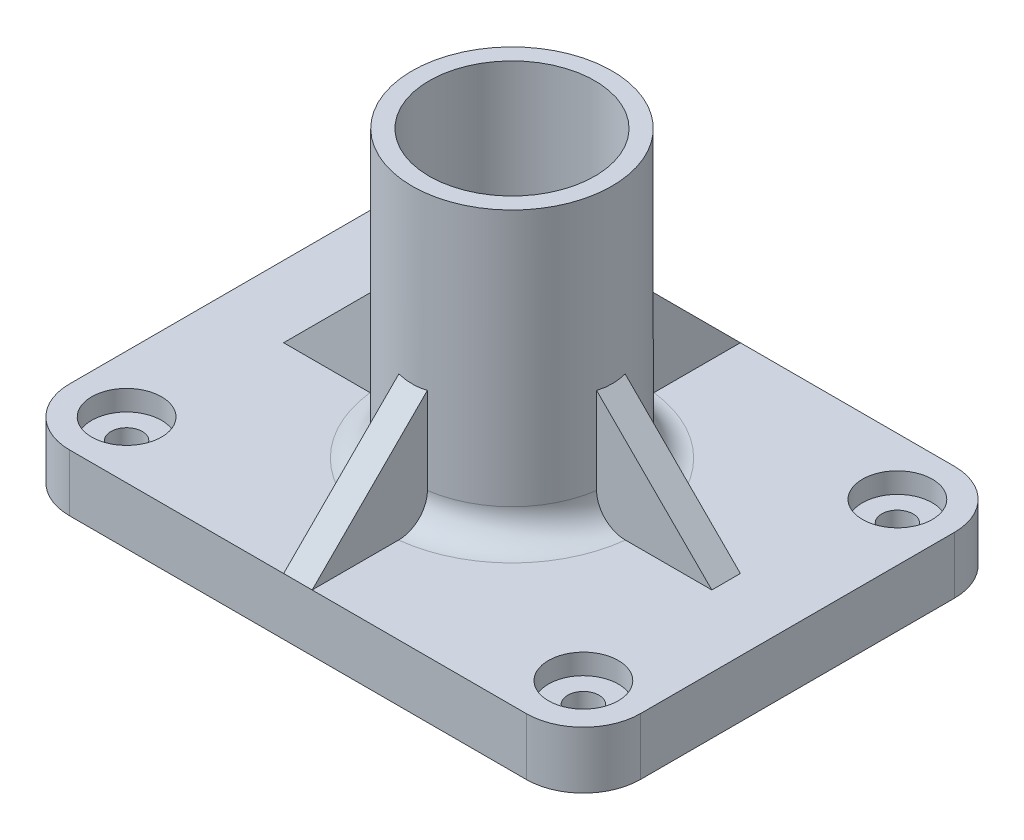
ISO-10303-21;
HEADER;
FILE_DESCRIPTION(('STEP AP214'),'2;1');
FILE_NAME('part.step','',(''),(''),'','','');
FILE_SCHEMA(('AUTOMOTIVE_DESIGN { 1 0 10303 214 1 1 1 1 }'));
ENDSEC;
DATA;
#1=APPLICATION_CONTEXT('core data for automotive mechanical design processes');
#2=APPLICATION_PROTOCOL_DEFINITION('international standard','automotive_design',2000,#1);
#3=PRODUCT_CONTEXT('',#1,'mechanical');
#4=PRODUCT('Part','Part','',(#3));
#5=PRODUCT_RELATED_PRODUCT_CATEGORY('part','',(#4));
#6=PRODUCT_DEFINITION_FORMATION('','',#4);
#7=PRODUCT_DEFINITION_CONTEXT('part definition',#1,'design');
#8=PRODUCT_DEFINITION('design','',#6,#7);
#9=PRODUCT_DEFINITION_SHAPE('','',#8);
#10=(LENGTH_UNIT() NAMED_UNIT(*) SI_UNIT(.MILLI.,.METRE.));
#11=(NAMED_UNIT(*) PLANE_ANGLE_UNIT() SI_UNIT($,.RADIAN.));
#12=(NAMED_UNIT(*) SI_UNIT($,.STERADIAN.) SOLID_ANGLE_UNIT());
#13=UNCERTAINTY_MEASURE_WITH_UNIT(LENGTH_MEASURE(1.E-05),#10,'distance_accuracy_value','');
#14=(GEOMETRIC_REPRESENTATION_CONTEXT(3) GLOBAL_UNCERTAINTY_ASSIGNED_CONTEXT((#13)) GLOBAL_UNIT_ASSIGNED_CONTEXT((#10,
#11,#12)) REPRESENTATION_CONTEXT('',''));
#15=CARTESIAN_POINT('',(0.,0.,0.));
#16=DIRECTION('',(0.,0.,1.));
#17=DIRECTION('',(1.,0.,0.));
#18=AXIS2_PLACEMENT_3D('',#15,#16,#17);
#19=CARTESIAN_POINT('',(-40.,10.,-27.5));
#20=DIRECTION('',(0.,1.,0.));
#21=DIRECTION('',(0.,0.,1.));
#22=AXIS2_PLACEMENT_3D('',#19,#20,#21);
#23=PLANE('',#22);
#24=CARTESIAN_POINT('',(-40.,10.,-27.5));
#25=DIRECTION('',(0.,1.,0.));
#26=DIRECTION('',(0.,0.,1.));
#27=AXIS2_PLACEMENT_3D('',#24,#25,#26);
#28=CIRCLE('',#27,6.12);
#29=CARTESIAN_POINT('',(-40.,10.,-21.38));
#30=VERTEX_POINT('',#29);
#31=EDGE_CURVE('E345',#30,#30,#28,.T.);
#32=ORIENTED_EDGE('',*,*,#31,.F.);
#33=EDGE_LOOP('',(#32));
#34=FACE_BOUND('',#33,.T.);
#35=CARTESIAN_POINT('',(-40.,10.,27.5));
#36=DIRECTION('',(0.,1.,0.));
#37=DIRECTION('',(0.,0.,1.));
#38=AXIS2_PLACEMENT_3D('',#35,#36,#37);
#39=CIRCLE('',#38,6.12);
#40=CARTESIAN_POINT('',(-40.,10.,33.62));
#41=VERTEX_POINT('',#40);
#42=EDGE_CURVE('E309',#41,#41,#39,.T.);
#43=ORIENTED_EDGE('',*,*,#42,.F.);
#44=EDGE_LOOP('',(#43));
#45=FACE_BOUND('',#44,.T.);
#46=DIRECTION('',(0.,0.,1.));
#47=VECTOR('',#46,1.);
#48=CARTESIAN_POINT('',(-2.4999999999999,10.,-27.4999999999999));
#49=LINE('',#48,#47);
#50=CARTESIAN_POINT('',(-2.50000000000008,10.,22.3606797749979));
#51=VERTEX_POINT('',#50);
#52=CARTESIAN_POINT('',(-2.50000000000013,10.,37.5));
#53=VERTEX_POINT('',#52);
#54=EDGE_CURVE('E264',#51,#53,#49,.T.);
#55=ORIENTED_EDGE('',*,*,#54,.F.);
#56=CARTESIAN_POINT('',(0.,10.,0.));
#57=DIRECTION('',(0.,1.,0.));
#58=DIRECTION('',(0.,0.,1.));
#59=AXIS2_PLACEMENT_3D('',#56,#57,#58);
#60=CIRCLE('',#59,22.5);
#61=CARTESIAN_POINT('',(-22.3606797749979,10.,2.49999999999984));
#62=VERTEX_POINT('',#61);
#63=EDGE_CURVE('E456',#51,#62,#60,.F.);
#64=ORIENTED_EDGE('',*,*,#63,.T.);
#65=DIRECTION('',(-1.,0.,0.));
#66=VECTOR('',#65,1.);
#67=CARTESIAN_POINT('',(-40.0000000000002,10.,2.49999999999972));
#68=LINE('',#67,#66);
#69=CARTESIAN_POINT('',(-37.5000000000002,10.,2.49999999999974));
#70=VERTEX_POINT('',#69);
#71=EDGE_CURVE('E246',#62,#70,#68,.T.);
#72=ORIENTED_EDGE('',*,*,#71,.T.);
#73=DIRECTION('',(0.,0.,1.));
#74=VECTOR('',#73,1.);
#75=CARTESIAN_POINT('',(-37.5,10.,-27.5));
#76=LINE('',#75,#74);
#77=CARTESIAN_POINT('',(-37.5000000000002,10.,-2.5000000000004));
#78=VERTEX_POINT('',#77);
#79=EDGE_CURVE('E251',#78,#70,#76,.T.);
#80=ORIENTED_EDGE('',*,*,#79,.F.);
#81=DIRECTION('',(-1.,0.,0.));
#82=VECTOR('',#81,1.);
#83=CARTESIAN_POINT('',(-40.0000000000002,10.,-2.50000000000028));
#84=LINE('',#83,#82);
#85=CARTESIAN_POINT('',(-22.3606797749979,10.,-2.50000000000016));
#86=VERTEX_POINT('',#85);
#87=EDGE_CURVE('E241',#86,#78,#84,.T.);
#88=ORIENTED_EDGE('',*,*,#87,.F.);
#89=CARTESIAN_POINT('',(0.,10.,0.));
#90=DIRECTION('',(0.,1.,0.));
#91=DIRECTION('',(0.,0.,1.));
#92=AXIS2_PLACEMENT_3D('',#89,#90,#91);
#93=CIRCLE('',#92,22.5);
#94=CARTESIAN_POINT('',(-2.49999999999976,10.,-22.3606797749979));
#95=VERTEX_POINT('',#94);
#96=EDGE_CURVE('E430',#86,#95,#93,.F.);
#97=ORIENTED_EDGE('',*,*,#96,.T.);
#98=DIRECTION('',(0.,0.,-1.));
#99=VECTOR('',#98,1.);
#100=CARTESIAN_POINT('',(-2.49999999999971,10.,-27.4999999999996));
#101=LINE('',#100,#99);
#102=CARTESIAN_POINT('',(-2.49999999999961,10.,-37.5));
#103=VERTEX_POINT('',#102);
#104=EDGE_CURVE('E208',#95,#103,#101,.T.);
#105=ORIENTED_EDGE('',*,*,#104,.T.);
#106=DIRECTION('',(-1.,0.,0.));
#107=VECTOR('',#106,1.);
#108=CARTESIAN_POINT('',(-40.,10.,-37.5));
#109=LINE('',#108,#107);
#110=CARTESIAN_POINT('',(-40.,10.,-37.5));
#111=VERTEX_POINT('',#110);
#112=EDGE_CURVE('E382',#103,#111,#109,.T.);
#113=ORIENTED_EDGE('',*,*,#112,.T.);
#114=CARTESIAN_POINT('',(-40.,10.,-27.5));
#115=DIRECTION('',(0.,1.,0.));
#116=DIRECTION('',(0.,0.,1.));
#117=AXIS2_PLACEMENT_3D('',#114,#115,#116);
#118=CIRCLE('',#117,10.);
#119=CARTESIAN_POINT('',(-50.,10.,-27.5));
#120=VERTEX_POINT('',#119);
#121=EDGE_CURVE('E365',#111,#120,#118,.T.);
#122=ORIENTED_EDGE('',*,*,#121,.T.);
#123=DIRECTION('',(0.,0.,1.));
#124=VECTOR('',#123,1.);
#125=CARTESIAN_POINT('',(-50.,10.,27.5));
#126=LINE('',#125,#124);
#127=CARTESIAN_POINT('',(-50.,10.,27.5));
#128=VERTEX_POINT('',#127);
#129=EDGE_CURVE('E368',#120,#128,#126,.T.);
#130=ORIENTED_EDGE('',*,*,#129,.T.);
#131=CARTESIAN_POINT('',(-40.,10.,27.5));
#132=DIRECTION('',(0.,1.,0.));
#133=DIRECTION('',(0.,0.,1.));
#134=AXIS2_PLACEMENT_3D('',#131,#132,#133);
#135=CIRCLE('',#134,10.);
#136=CARTESIAN_POINT('',(-40.,10.,37.5));
#137=VERTEX_POINT('',#136);
#138=EDGE_CURVE('E370',#128,#137,#135,.T.);
#139=ORIENTED_EDGE('',*,*,#138,.T.);
#140=DIRECTION('',(1.,0.,0.));
#141=VECTOR('',#140,1.);
#142=CARTESIAN_POINT('',(-40.,10.,37.5));
#143=LINE('',#142,#141);
#144=EDGE_CURVE('E373',#137,#53,#143,.T.);
#145=ORIENTED_EDGE('',*,*,#144,.T.);
#146=EDGE_LOOP('',(#55,#64,#72,#80,#88,#97,#105,#113,#122,#130,#139,#145));
#147=FACE_BOUND('',#146,.T.);
#148=ADVANCED_FACE('F32',(#34,#45,#147),#23,.T.);
#149=DIRECTION('',(0.,0.,-1.));
#150=VECTOR('',#149,1.);
#151=CARTESIAN_POINT('',(2.50000000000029,10.,-27.4999999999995));
#152=LINE('',#151,#150);
#153=CARTESIAN_POINT('',(2.50000000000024,10.,-22.3606797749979));
#154=VERTEX_POINT('',#153);
#155=CARTESIAN_POINT('',(2.5000000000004,10.,-37.5));
#156=VERTEX_POINT('',#155);
#157=EDGE_CURVE('E227',#154,#156,#152,.T.);
#158=ORIENTED_EDGE('',*,*,#157,.F.);
#159=CARTESIAN_POINT('',(0.,10.,0.));
#160=DIRECTION('',(0.,1.,0.));
#161=DIRECTION('',(0.,0.,1.));
#162=AXIS2_PLACEMENT_3D('',#159,#160,#161);
#163=CIRCLE('',#162,22.5);
#164=CARTESIAN_POINT('',(22.3606797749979,10.,-2.5));
#165=VERTEX_POINT('',#164);
#166=EDGE_CURVE('E634',#154,#165,#163,.F.);
#167=ORIENTED_EDGE('',*,*,#166,.T.);
#168=DIRECTION('',(1.,0.,0.));
#169=VECTOR('',#168,1.);
#170=CARTESIAN_POINT('',(-40.,10.,-2.5));
#171=LINE('',#170,#169);
#172=CARTESIAN_POINT('',(37.5000000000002,10.,-2.5));
#173=VERTEX_POINT('',#172);
#174=EDGE_CURVE('E281',#165,#173,#171,.T.);
#175=ORIENTED_EDGE('',*,*,#174,.T.);
#176=DIRECTION('',(0.,0.,-1.));
#177=VECTOR('',#176,1.);
#178=CARTESIAN_POINT('',(37.5000000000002,10.,-27.5));
#179=LINE('',#178,#177);
#180=CARTESIAN_POINT('',(37.5000000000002,10.,2.5));
#181=VERTEX_POINT('',#180);
#182=EDGE_CURVE('E291',#181,#173,#179,.T.);
#183=ORIENTED_EDGE('',*,*,#182,.F.);
#184=DIRECTION('',(1.,0.,0.));
#185=VECTOR('',#184,1.);
#186=CARTESIAN_POINT('',(-40.,10.,2.5));
#187=LINE('',#186,#185);
#188=CARTESIAN_POINT('',(22.3606797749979,10.,2.5));
#189=VERTEX_POINT('',#188);
#190=EDGE_CURVE('E285',#189,#181,#187,.T.);
#191=ORIENTED_EDGE('',*,*,#190,.F.);
#192=CARTESIAN_POINT('',(0.,10.,0.));
#193=DIRECTION('',(0.,1.,0.));
#194=DIRECTION('',(0.,0.,1.));
#195=AXIS2_PLACEMENT_3D('',#192,#193,#194);
#196=CIRCLE('',#195,22.5);
#197=CARTESIAN_POINT('',(2.49999999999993,10.,22.3606797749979));
#198=VERTEX_POINT('',#197);
#199=EDGE_CURVE('E52',#189,#198,#196,.F.);
#200=ORIENTED_EDGE('',*,*,#199,.T.);
#201=DIRECTION('',(0.,0.,1.));
#202=VECTOR('',#201,1.);
#203=CARTESIAN_POINT('',(2.5000000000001,10.,-27.4999999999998));
#204=LINE('',#203,#202);
#205=CARTESIAN_POINT('',(2.49999999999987,10.,37.5));
#206=VERTEX_POINT('',#205);
#207=EDGE_CURVE('E260',#198,#206,#204,.T.);
#208=ORIENTED_EDGE('',*,*,#207,.T.);
#209=CARTESIAN_POINT('',(40.,10.,37.5));
#210=VERTEX_POINT('',#209);
#211=EDGE_CURVE('E372',#206,#210,#143,.T.);
#212=ORIENTED_EDGE('',*,*,#211,.T.);
#213=CARTESIAN_POINT('',(40.,10.,27.5));
#214=DIRECTION('',(0.,1.,0.));
#215=DIRECTION('',(0.,0.,-1.));
#216=AXIS2_PLACEMENT_3D('',#213,#214,#215);
#217=CIRCLE('',#216,10.);
#218=CARTESIAN_POINT('',(50.,10.,27.5));
#219=VERTEX_POINT('',#218);
#220=EDGE_CURVE('E376',#210,#219,#217,.T.);
#221=ORIENTED_EDGE('',*,*,#220,.T.);
#222=DIRECTION('',(0.,0.,-1.));
#223=VECTOR('',#222,1.);
#224=CARTESIAN_POINT('',(50.,10.,27.5));
#225=LINE('',#224,#223);
#226=CARTESIAN_POINT('',(50.,10.,-27.5));
#227=VERTEX_POINT('',#226);
#228=EDGE_CURVE('E378',#219,#227,#225,.T.);
#229=ORIENTED_EDGE('',*,*,#228,.T.);
#230=CARTESIAN_POINT('',(40.,10.,-27.5));
#231=DIRECTION('',(0.,1.,0.));
#232=DIRECTION('',(0.,0.,1.));
#233=AXIS2_PLACEMENT_3D('',#230,#231,#232);
#234=CIRCLE('',#233,10.);
#235=CARTESIAN_POINT('',(40.,10.,-37.5));
#236=VERTEX_POINT('',#235);
#237=EDGE_CURVE('E380',#227,#236,#234,.T.);
#238=ORIENTED_EDGE('',*,*,#237,.T.);
#239=EDGE_CURVE('E383',#236,#156,#109,.T.);
#240=ORIENTED_EDGE('',*,*,#239,.T.);
#241=EDGE_LOOP('',(#158,#167,#175,#183,#191,#200,#208,#212,#221,#229,#238,#240));
#242=FACE_BOUND('',#241,.T.);
#243=CARTESIAN_POINT('',(40.,10.,-27.5));
#244=DIRECTION('',(0.,1.,0.));
#245=DIRECTION('',(0.,0.,1.));
#246=AXIS2_PLACEMENT_3D('',#243,#244,#245);
#247=CIRCLE('',#246,6.12);
#248=CARTESIAN_POINT('',(40.,10.,-21.38));
#249=VERTEX_POINT('',#248);
#250=EDGE_CURVE('E321',#249,#249,#247,.T.);
#251=ORIENTED_EDGE('',*,*,#250,.F.);
#252=EDGE_LOOP('',(#251));
#253=FACE_BOUND('',#252,.T.);
#254=CARTESIAN_POINT('',(40.,10.,27.5));
#255=DIRECTION('',(0.,1.,0.));
#256=DIRECTION('',(0.,0.,1.));
#257=AXIS2_PLACEMENT_3D('',#254,#255,#256);
#258=CIRCLE('',#257,6.12);
#259=CARTESIAN_POINT('',(40.,10.,33.62));
#260=VERTEX_POINT('',#259);
#261=EDGE_CURVE('E333',#260,#260,#258,.T.);
#262=ORIENTED_EDGE('',*,*,#261,.F.);
#263=EDGE_LOOP('',(#262));
#264=FACE_BOUND('',#263,.T.);
#265=ADVANCED_FACE('F485',(#242,#253,#264),#23,.T.);
#266=CARTESIAN_POINT('',(-40.,10.,-27.5));
#267=DIRECTION('',(0.,-1.,0.));
#268=DIRECTION('',(0.,0.,-1.));
#269=AXIS2_PLACEMENT_3D('',#266,#267,#268);
#270=CYLINDRICAL_SURFACE('',#269,10.);
#271=CARTESIAN_POINT('',(-40.,0.,-27.5));
#272=DIRECTION('',(0.,1.,0.));
#273=DIRECTION('',(0.,0.,1.));
#274=AXIS2_PLACEMENT_3D('',#271,#272,#273);
#275=CIRCLE('',#274,10.);
#276=CARTESIAN_POINT('',(-40.,0.,-37.5));
#277=VERTEX_POINT('',#276);
#278=CARTESIAN_POINT('',(-50.,0.,-27.5));
#279=VERTEX_POINT('',#278);
#280=EDGE_CURVE('E348',#277,#279,#275,.T.);
#281=ORIENTED_EDGE('',*,*,#280,.T.);
#282=DIRECTION('',(0.,-1.,0.));
#283=VECTOR('',#282,1.);
#284=CARTESIAN_POINT('',(-50.,10.,-27.5));
#285=LINE('',#284,#283);
#286=EDGE_CURVE('E407',#120,#279,#285,.T.);
#287=ORIENTED_EDGE('',*,*,#286,.F.);
#288=ORIENTED_EDGE('',*,*,#121,.F.);
#289=DIRECTION('',(0.,-1.,0.));
#290=VECTOR('',#289,1.);
#291=CARTESIAN_POINT('',(-40.,10.,-37.5));
#292=LINE('',#291,#290);
#293=EDGE_CURVE('E386',#111,#277,#292,.T.);
#294=ORIENTED_EDGE('',*,*,#293,.T.);
#295=EDGE_LOOP('',(#281,#287,#288,#294));
#296=FACE_BOUND('',#295,.T.);
#297=ADVANCED_FACE('F34',(#296),#270,.T.);
#298=CARTESIAN_POINT('',(-50.,10.,27.5));
#299=DIRECTION('',(1.,0.,0.));
#300=DIRECTION('',(0.,0.,-1.));
#301=AXIS2_PLACEMENT_3D('',#298,#299,#300);
#302=PLANE('',#301);
#303=DIRECTION('',(0.,-1.,0.));
#304=VECTOR('',#303,1.);
#305=CARTESIAN_POINT('',(-50.,10.,27.5));
#306=LINE('',#305,#304);
#307=CARTESIAN_POINT('',(-50.,0.,27.5));
#308=VERTEX_POINT('',#307);
#309=EDGE_CURVE('E404',#128,#308,#306,.T.);
#310=ORIENTED_EDGE('',*,*,#309,.F.);
#311=ORIENTED_EDGE('',*,*,#129,.F.);
#312=ORIENTED_EDGE('',*,*,#286,.T.);
#313=DIRECTION('',(0.,0.,1.));
#314=VECTOR('',#313,1.);
#315=CARTESIAN_POINT('',(-50.,0.,27.5));
#316=LINE('',#315,#314);
#317=EDGE_CURVE('E351',#279,#308,#316,.T.);
#318=ORIENTED_EDGE('',*,*,#317,.T.);
#319=EDGE_LOOP('',(#310,#311,#312,#318));
#320=FACE_BOUND('',#319,.T.);
#321=ADVANCED_FACE('F672',(#320),#302,.F.);
#322=CARTESIAN_POINT('',(-40.,10.,27.5));
#323=DIRECTION('',(0.,-1.,0.));
#324=DIRECTION('',(0.,0.,-1.));
#325=AXIS2_PLACEMENT_3D('',#322,#323,#324);
#326=CYLINDRICAL_SURFACE('',#325,10.);
#327=CARTESIAN_POINT('',(-40.,0.,27.5));
#328=DIRECTION('',(0.,1.,0.));
#329=DIRECTION('',(0.,0.,1.));
#330=AXIS2_PLACEMENT_3D('',#327,#328,#329);
#331=CIRCLE('',#330,10.);
#332=CARTESIAN_POINT('',(-40.,0.,37.5));
#333=VERTEX_POINT('',#332);
#334=EDGE_CURVE('E353',#308,#333,#331,.T.);
#335=ORIENTED_EDGE('',*,*,#334,.T.);
#336=DIRECTION('',(0.,-1.,0.));
#337=VECTOR('',#336,1.);
#338=CARTESIAN_POINT('',(-40.,10.,37.5));
#339=LINE('',#338,#337);
#340=EDGE_CURVE('E401',#137,#333,#339,.T.);
#341=ORIENTED_EDGE('',*,*,#340,.F.);
#342=ORIENTED_EDGE('',*,*,#138,.F.);
#343=ORIENTED_EDGE('',*,*,#309,.T.);
#344=EDGE_LOOP('',(#335,#341,#342,#343));
#345=FACE_BOUND('',#344,.T.);
#346=ADVANCED_FACE('F677',(#345),#326,.T.);
#347=CARTESIAN_POINT('',(-40.,10.,37.5));
#348=DIRECTION('',(0.,0.,-1.));
#349=DIRECTION('',(-1.,0.,0.));
#350=AXIS2_PLACEMENT_3D('',#347,#348,#349);
#351=PLANE('',#350);
#352=ORIENTED_EDGE('',*,*,#211,.F.);
#353=DIRECTION('',(1.,0.,0.));
#354=VECTOR('',#353,1.);
#355=CARTESIAN_POINT('',(-40.,10.0000000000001,37.5));
#356=LINE('',#355,#354);
#357=EDGE_CURVE('E271',#53,#206,#356,.T.);
#358=ORIENTED_EDGE('',*,*,#357,.F.);
#359=ORIENTED_EDGE('',*,*,#144,.F.);
#360=ORIENTED_EDGE('',*,*,#340,.T.);
#361=DIRECTION('',(1.,0.,0.));
#362=VECTOR('',#361,1.);
#363=CARTESIAN_POINT('',(-40.,0.,37.5));
#364=LINE('',#363,#362);
#365=CARTESIAN_POINT('',(40.,0.,37.5));
#366=VERTEX_POINT('',#365);
#367=EDGE_CURVE('E355',#333,#366,#364,.T.);
#368=ORIENTED_EDGE('',*,*,#367,.T.);
#369=DIRECTION('',(0.,-1.,0.));
#370=VECTOR('',#369,1.);
#371=CARTESIAN_POINT('',(40.,10.,37.5));
#372=LINE('',#371,#370);
#373=EDGE_CURVE('E398',#210,#366,#372,.T.);
#374=ORIENTED_EDGE('',*,*,#373,.F.);
#375=EDGE_LOOP('',(#352,#358,#359,#360,#368,#374));
#376=FACE_BOUND('',#375,.T.);
#377=ADVANCED_FACE('F680',(#376),#351,.F.);
#378=CARTESIAN_POINT('',(40.,10.,27.5));
#379=DIRECTION('',(0.,-1.,0.));
#380=DIRECTION('',(0.,0.,-1.));
#381=AXIS2_PLACEMENT_3D('',#378,#379,#380);
#382=CYLINDRICAL_SURFACE('',#381,10.);
#383=CARTESIAN_POINT('',(40.,0.,27.5));
#384=DIRECTION('',(0.,1.,0.));
#385=DIRECTION('',(0.,0.,-1.));
#386=AXIS2_PLACEMENT_3D('',#383,#384,#385);
#387=CIRCLE('',#386,10.);
#388=CARTESIAN_POINT('',(50.,0.,27.5));
#389=VERTEX_POINT('',#388);
#390=EDGE_CURVE('E357',#366,#389,#387,.T.);
#391=ORIENTED_EDGE('',*,*,#390,.T.);
#392=DIRECTION('',(0.,-1.,0.));
#393=VECTOR('',#392,1.);
#394=CARTESIAN_POINT('',(50.,10.,27.5));
#395=LINE('',#394,#393);
#396=EDGE_CURVE('E395',#219,#389,#395,.T.);
#397=ORIENTED_EDGE('',*,*,#396,.F.);
#398=ORIENTED_EDGE('',*,*,#220,.F.);
#399=ORIENTED_EDGE('',*,*,#373,.T.);
#400=EDGE_LOOP('',(#391,#397,#398,#399));
#401=FACE_BOUND('',#400,.T.);
#402=ADVANCED_FACE('F787',(#401),#382,.T.);
#403=CARTESIAN_POINT('',(50.,10.,27.5));
#404=DIRECTION('',(-1.,0.,0.));
#405=DIRECTION('',(0.,0.,1.));
#406=AXIS2_PLACEMENT_3D('',#403,#404,#405);
#407=PLANE('',#406);
#408=DIRECTION('',(0.,-1.,0.));
#409=VECTOR('',#408,1.);
#410=CARTESIAN_POINT('',(50.,10.,-27.5));
#411=LINE('',#410,#409);
#412=CARTESIAN_POINT('',(50.,0.,-27.5));
#413=VERTEX_POINT('',#412);
#414=EDGE_CURVE('E392',#227,#413,#411,.T.);
#415=ORIENTED_EDGE('',*,*,#414,.F.);
#416=ORIENTED_EDGE('',*,*,#228,.F.);
#417=ORIENTED_EDGE('',*,*,#396,.T.);
#418=DIRECTION('',(0.,0.,-1.));
#419=VECTOR('',#418,1.);
#420=CARTESIAN_POINT('',(50.,0.,27.5));
#421=LINE('',#420,#419);
#422=EDGE_CURVE('E359',#389,#413,#421,.T.);
#423=ORIENTED_EDGE('',*,*,#422,.T.);
#424=EDGE_LOOP('',(#415,#416,#417,#423));
#425=FACE_BOUND('',#424,.T.);
#426=ADVANCED_FACE('F782',(#425),#407,.F.);
#427=CARTESIAN_POINT('',(40.,10.,-27.5));
#428=DIRECTION('',(0.,-1.,0.));
#429=DIRECTION('',(0.,0.,-1.));
#430=AXIS2_PLACEMENT_3D('',#427,#428,#429);
#431=CYLINDRICAL_SURFACE('',#430,10.);
#432=CARTESIAN_POINT('',(40.,0.,-27.5));
#433=DIRECTION('',(0.,1.,0.));
#434=DIRECTION('',(0.,0.,1.));
#435=AXIS2_PLACEMENT_3D('',#432,#433,#434);
#436=CIRCLE('',#435,10.);
#437=CARTESIAN_POINT('',(40.,0.,-37.5));
#438=VERTEX_POINT('',#437);
#439=EDGE_CURVE('E361',#413,#438,#436,.T.);
#440=ORIENTED_EDGE('',*,*,#439,.T.);
#441=DIRECTION('',(0.,-1.,0.));
#442=VECTOR('',#441,1.);
#443=CARTESIAN_POINT('',(40.,10.,-37.5));
#444=LINE('',#443,#442);
#445=EDGE_CURVE('E389',#236,#438,#444,.T.);
#446=ORIENTED_EDGE('',*,*,#445,.F.);
#447=ORIENTED_EDGE('',*,*,#237,.F.);
#448=ORIENTED_EDGE('',*,*,#414,.T.);
#449=EDGE_LOOP('',(#440,#446,#447,#448));
#450=FACE_BOUND('',#449,.T.);
#451=ADVANCED_FACE('F577',(#450),#431,.T.);
#452=CARTESIAN_POINT('',(-40.,10.,-37.5));
#453=DIRECTION('',(0.,0.,1.));
#454=DIRECTION('',(1.,0.,0.));
#455=AXIS2_PLACEMENT_3D('',#452,#453,#454);
#456=PLANE('',#455);
#457=DIRECTION('',(-1.,0.,0.));
#458=VECTOR('',#457,1.);
#459=CARTESIAN_POINT('',(-40.,0.,-37.5));
#460=LINE('',#459,#458);
#461=EDGE_CURVE('E363',#438,#277,#460,.T.);
#462=ORIENTED_EDGE('',*,*,#461,.T.);
#463=ORIENTED_EDGE('',*,*,#293,.F.);
#464=ORIENTED_EDGE('',*,*,#112,.F.);
#465=DIRECTION('',(-1.,0.,0.));
#466=VECTOR('',#465,1.);
#467=CARTESIAN_POINT('',(-40.,10.0000000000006,-37.5));
#468=LINE('',#467,#466);
#469=EDGE_CURVE('E220',#156,#103,#468,.T.);
#470=ORIENTED_EDGE('',*,*,#469,.F.);
#471=ORIENTED_EDGE('',*,*,#239,.F.);
#472=ORIENTED_EDGE('',*,*,#445,.T.);
#473=EDGE_LOOP('',(#462,#463,#464,#470,#471,#472));
#474=FACE_BOUND('',#473,.T.);
#475=ADVANCED_FACE('F572',(#474),#456,.F.);
#476=CARTESIAN_POINT('',(-40.,0.,-27.5));
#477=DIRECTION('',(0.,1.,0.));
#478=DIRECTION('',(0.,0.,1.));
#479=AXIS2_PLACEMENT_3D('',#476,#477,#478);
#480=PLANE('',#479);
#481=ORIENTED_EDGE('',*,*,#390,.F.);
#482=ORIENTED_EDGE('',*,*,#367,.F.);
#483=ORIENTED_EDGE('',*,*,#334,.F.);
#484=ORIENTED_EDGE('',*,*,#317,.F.);
#485=ORIENTED_EDGE('',*,*,#280,.F.);
#486=ORIENTED_EDGE('',*,*,#461,.F.);
#487=ORIENTED_EDGE('',*,*,#439,.F.);
#488=ORIENTED_EDGE('',*,*,#422,.F.);
#489=EDGE_LOOP('',(#481,#482,#483,#484,#485,#486,#487,#488));
#490=FACE_BOUND('',#489,.T.);
#491=CARTESIAN_POINT('',(40.,0.,27.5));
#492=DIRECTION('',(0.,1.,0.));
#493=DIRECTION('',(0.,0.,1.));
#494=AXIS2_PLACEMENT_3D('',#491,#492,#493);
#495=CIRCLE('',#494,2.75);
#496=CARTESIAN_POINT('',(40.,0.,30.25));
#497=VERTEX_POINT('',#496);
#498=EDGE_CURVE('E324',#497,#497,#495,.T.);
#499=ORIENTED_EDGE('',*,*,#498,.T.);
#500=EDGE_LOOP('',(#499));
#501=FACE_BOUND('',#500,.T.);
#502=CARTESIAN_POINT('',(40.,0.,-27.5));
#503=DIRECTION('',(0.,1.,0.));
#504=DIRECTION('',(0.,0.,1.));
#505=AXIS2_PLACEMENT_3D('',#502,#503,#504);
#506=CIRCLE('',#505,2.75);
#507=CARTESIAN_POINT('',(40.,0.,-24.75));
#508=VERTEX_POINT('',#507);
#509=EDGE_CURVE('E312',#508,#508,#506,.T.);
#510=ORIENTED_EDGE('',*,*,#509,.T.);
#511=EDGE_LOOP('',(#510));
#512=FACE_BOUND('',#511,.T.);
#513=CARTESIAN_POINT('',(-40.,0.,-27.5));
#514=DIRECTION('',(0.,1.,0.));
#515=DIRECTION('',(0.,0.,1.));
#516=AXIS2_PLACEMENT_3D('',#513,#514,#515);
#517=CIRCLE('',#516,2.75);
#518=CARTESIAN_POINT('',(-40.,0.,-24.75));
#519=VERTEX_POINT('',#518);
#520=EDGE_CURVE('E336',#519,#519,#517,.T.);
#521=ORIENTED_EDGE('',*,*,#520,.T.);
#522=EDGE_LOOP('',(#521));
#523=FACE_BOUND('',#522,.T.);
#524=CARTESIAN_POINT('',(-40.,0.,27.5));
#525=DIRECTION('',(0.,1.,0.));
#526=DIRECTION('',(0.,0.,1.));
#527=AXIS2_PLACEMENT_3D('',#524,#525,#526);
#528=CIRCLE('',#527,2.75);
#529=CARTESIAN_POINT('',(-40.,0.,30.25));
#530=VERTEX_POINT('',#529);
#531=EDGE_CURVE('E300',#530,#530,#528,.T.);
#532=ORIENTED_EDGE('',*,*,#531,.T.);
#533=EDGE_LOOP('',(#532));
#534=FACE_BOUND('',#533,.T.);
#535=ADVANCED_FACE('F569',(#490,#501,#512,#523,#534),#480,.F.);
#536=CARTESIAN_POINT('',(-40.,10.,-27.5));
#537=DIRECTION('',(0.,1.,0.));
#538=DIRECTION('',(0.,0.,1.));
#539=AXIS2_PLACEMENT_3D('',#536,#537,#538);
#540=CYLINDRICAL_SURFACE('',#539,6.12);
#541=CARTESIAN_POINT('',(-40.,6.42,-27.5));
#542=DIRECTION('',(0.,1.,0.));
#543=DIRECTION('',(0.,0.,1.));
#544=AXIS2_PLACEMENT_3D('',#541,#542,#543);
#545=CIRCLE('',#544,6.12);
#546=CARTESIAN_POINT('',(-40.,6.42,-21.38));
#547=VERTEX_POINT('',#546);
#548=EDGE_CURVE('E342',#547,#547,#545,.T.);
#549=ORIENTED_EDGE('',*,*,#548,.F.);
#550=EDGE_LOOP('',(#549));
#551=FACE_BOUND('',#550,.T.);
#552=ORIENTED_EDGE('',*,*,#31,.T.);
#553=EDGE_LOOP('',(#552));
#554=FACE_BOUND('',#553,.T.);
#555=ADVANCED_FACE('F566',(#551,#554),#540,.F.);
#556=CARTESIAN_POINT('',(-37.25,6.42,-27.5));
#557=DIRECTION('',(0.,-1.,0.));
#558=DIRECTION('',(0.,0.,-1.));
#559=AXIS2_PLACEMENT_3D('',#556,#557,#558);
#560=PLANE('',#559);
#561=CARTESIAN_POINT('',(-40.,6.42,-27.5));
#562=DIRECTION('',(0.,1.,0.));
#563=DIRECTION('',(0.,0.,1.));
#564=AXIS2_PLACEMENT_3D('',#561,#562,#563);
#565=CIRCLE('',#564,2.75);
#566=CARTESIAN_POINT('',(-40.,6.42,-24.75));
#567=VERTEX_POINT('',#566);
#568=EDGE_CURVE('E339',#567,#567,#565,.T.);
#569=ORIENTED_EDGE('',*,*,#568,.F.);
#570=EDGE_LOOP('',(#569));
#571=FACE_BOUND('',#570,.T.);
#572=ORIENTED_EDGE('',*,*,#548,.T.);
#573=EDGE_LOOP('',(#572));
#574=FACE_BOUND('',#573,.T.);
#575=ADVANCED_FACE('F562',(#571,#574),#560,.F.);
#576=CARTESIAN_POINT('',(-40.,10.,-27.5));
#577=DIRECTION('',(0.,1.,0.));
#578=DIRECTION('',(0.,0.,1.));
#579=AXIS2_PLACEMENT_3D('',#576,#577,#578);
#580=CYLINDRICAL_SURFACE('',#579,2.75);
#581=ORIENTED_EDGE('',*,*,#520,.F.);
#582=EDGE_LOOP('',(#581));
#583=FACE_BOUND('',#582,.T.);
#584=ORIENTED_EDGE('',*,*,#568,.T.);
#585=EDGE_LOOP('',(#584));
#586=FACE_BOUND('',#585,.T.);
#587=ADVANCED_FACE('F558',(#583,#586),#580,.F.);
#588=CARTESIAN_POINT('',(40.,10.,27.5));
#589=DIRECTION('',(0.,1.,0.));
#590=DIRECTION('',(0.,0.,1.));
#591=AXIS2_PLACEMENT_3D('',#588,#589,#590);
#592=CYLINDRICAL_SURFACE('',#591,6.12);
#593=CARTESIAN_POINT('',(40.,6.42,27.5));
#594=DIRECTION('',(0.,1.,0.));
#595=DIRECTION('',(0.,0.,1.));
#596=AXIS2_PLACEMENT_3D('',#593,#594,#595);
#597=CIRCLE('',#596,6.12);
#598=CARTESIAN_POINT('',(40.,6.42,33.62));
#599=VERTEX_POINT('',#598);
#600=EDGE_CURVE('E330',#599,#599,#597,.T.);
#601=ORIENTED_EDGE('',*,*,#600,.F.);
#602=EDGE_LOOP('',(#601));
#603=FACE_BOUND('',#602,.T.);
#604=ORIENTED_EDGE('',*,*,#261,.T.);
#605=EDGE_LOOP('',(#604));
#606=FACE_BOUND('',#605,.T.);
#607=ADVANCED_FACE('F554',(#603,#606),#592,.F.);
#608=CARTESIAN_POINT('',(42.75,6.42,27.5));
#609=DIRECTION('',(0.,-1.,0.));
#610=DIRECTION('',(0.,0.,-1.));
#611=AXIS2_PLACEMENT_3D('',#608,#609,#610);
#612=PLANE('',#611);
#613=CARTESIAN_POINT('',(40.,6.42,27.5));
#614=DIRECTION('',(0.,1.,0.));
#615=DIRECTION('',(0.,0.,1.));
#616=AXIS2_PLACEMENT_3D('',#613,#614,#615);
#617=CIRCLE('',#616,2.75);
#618=CARTESIAN_POINT('',(40.,6.42,30.25));
#619=VERTEX_POINT('',#618);
#620=EDGE_CURVE('E327',#619,#619,#617,.T.);
#621=ORIENTED_EDGE('',*,*,#620,.F.);
#622=EDGE_LOOP('',(#621));
#623=FACE_BOUND('',#622,.T.);
#624=ORIENTED_EDGE('',*,*,#600,.T.);
#625=EDGE_LOOP('',(#624));
#626=FACE_BOUND('',#625,.T.);
#627=ADVANCED_FACE('F550',(#623,#626),#612,.F.);
#628=CARTESIAN_POINT('',(40.,10.,27.5));
#629=DIRECTION('',(0.,1.,0.));
#630=DIRECTION('',(0.,0.,1.));
#631=AXIS2_PLACEMENT_3D('',#628,#629,#630);
#632=CYLINDRICAL_SURFACE('',#631,2.75);
#633=ORIENTED_EDGE('',*,*,#498,.F.);
#634=EDGE_LOOP('',(#633));
#635=FACE_BOUND('',#634,.T.);
#636=ORIENTED_EDGE('',*,*,#620,.T.);
#637=EDGE_LOOP('',(#636));
#638=FACE_BOUND('',#637,.T.);
#639=ADVANCED_FACE('F546',(#635,#638),#632,.F.);
#640=CARTESIAN_POINT('',(40.,10.,-27.5));
#641=DIRECTION('',(0.,1.,0.));
#642=DIRECTION('',(0.,0.,1.));
#643=AXIS2_PLACEMENT_3D('',#640,#641,#642);
#644=CYLINDRICAL_SURFACE('',#643,6.12);
#645=CARTESIAN_POINT('',(40.,6.42,-27.5));
#646=DIRECTION('',(0.,1.,0.));
#647=DIRECTION('',(0.,0.,1.));
#648=AXIS2_PLACEMENT_3D('',#645,#646,#647);
#649=CIRCLE('',#648,6.12);
#650=CARTESIAN_POINT('',(40.,6.42,-21.38));
#651=VERTEX_POINT('',#650);
#652=EDGE_CURVE('E318',#651,#651,#649,.T.);
#653=ORIENTED_EDGE('',*,*,#652,.F.);
#654=EDGE_LOOP('',(#653));
#655=FACE_BOUND('',#654,.T.);
#656=ORIENTED_EDGE('',*,*,#250,.T.);
#657=EDGE_LOOP('',(#656));
#658=FACE_BOUND('',#657,.T.);
#659=ADVANCED_FACE('F542',(#655,#658),#644,.F.);
#660=CARTESIAN_POINT('',(42.75,6.42,-27.5));
#661=DIRECTION('',(0.,-1.,0.));
#662=DIRECTION('',(0.,0.,-1.));
#663=AXIS2_PLACEMENT_3D('',#660,#661,#662);
#664=PLANE('',#663);
#665=CARTESIAN_POINT('',(40.,6.42,-27.5));
#666=DIRECTION('',(0.,1.,0.));
#667=DIRECTION('',(0.,0.,1.));
#668=AXIS2_PLACEMENT_3D('',#665,#666,#667);
#669=CIRCLE('',#668,2.75);
#670=CARTESIAN_POINT('',(40.,6.42,-24.75));
#671=VERTEX_POINT('',#670);
#672=EDGE_CURVE('E315',#671,#671,#669,.T.);
#673=ORIENTED_EDGE('',*,*,#672,.F.);
#674=EDGE_LOOP('',(#673));
#675=FACE_BOUND('',#674,.T.);
#676=ORIENTED_EDGE('',*,*,#652,.T.);
#677=EDGE_LOOP('',(#676));
#678=FACE_BOUND('',#677,.T.);
#679=ADVANCED_FACE('F538',(#675,#678),#664,.F.);
#680=CARTESIAN_POINT('',(40.,10.,-27.5));
#681=DIRECTION('',(0.,1.,0.));
#682=DIRECTION('',(0.,0.,1.));
#683=AXIS2_PLACEMENT_3D('',#680,#681,#682);
#684=CYLINDRICAL_SURFACE('',#683,2.75);
#685=ORIENTED_EDGE('',*,*,#509,.F.);
#686=EDGE_LOOP('',(#685));
#687=FACE_BOUND('',#686,.T.);
#688=ORIENTED_EDGE('',*,*,#672,.T.);
#689=EDGE_LOOP('',(#688));
#690=FACE_BOUND('',#689,.T.);
#691=ADVANCED_FACE('F534',(#687,#690),#684,.F.);
#692=CARTESIAN_POINT('',(-40.,10.,27.5));
#693=DIRECTION('',(0.,1.,0.));
#694=DIRECTION('',(0.,0.,1.));
#695=AXIS2_PLACEMENT_3D('',#692,#693,#694);
#696=CYLINDRICAL_SURFACE('',#695,6.12);
#697=CARTESIAN_POINT('',(-40.,6.42,27.5));
#698=DIRECTION('',(0.,1.,0.));
#699=DIRECTION('',(0.,0.,1.));
#700=AXIS2_PLACEMENT_3D('',#697,#698,#699);
#701=CIRCLE('',#700,6.12);
#702=CARTESIAN_POINT('',(-40.,6.42,33.62));
#703=VERTEX_POINT('',#702);
#704=EDGE_CURVE('E306',#703,#703,#701,.T.);
#705=ORIENTED_EDGE('',*,*,#704,.F.);
#706=EDGE_LOOP('',(#705));
#707=FACE_BOUND('',#706,.T.);
#708=ORIENTED_EDGE('',*,*,#42,.T.);
#709=EDGE_LOOP('',(#708));
#710=FACE_BOUND('',#709,.T.);
#711=ADVANCED_FACE('F530',(#707,#710),#696,.F.);
#712=CARTESIAN_POINT('',(-37.25,6.42,27.5));
#713=DIRECTION('',(0.,-1.,0.));
#714=DIRECTION('',(0.,0.,-1.));
#715=AXIS2_PLACEMENT_3D('',#712,#713,#714);
#716=PLANE('',#715);
#717=CARTESIAN_POINT('',(-40.,6.42,27.5));
#718=DIRECTION('',(0.,1.,0.));
#719=DIRECTION('',(0.,0.,1.));
#720=AXIS2_PLACEMENT_3D('',#717,#718,#719);
#721=CIRCLE('',#720,2.75);
#722=CARTESIAN_POINT('',(-40.,6.42,30.25));
#723=VERTEX_POINT('',#722);
#724=EDGE_CURVE('E303',#723,#723,#721,.T.);
#725=ORIENTED_EDGE('',*,*,#724,.F.);
#726=EDGE_LOOP('',(#725));
#727=FACE_BOUND('',#726,.T.);
#728=ORIENTED_EDGE('',*,*,#704,.T.);
#729=EDGE_LOOP('',(#728));
#730=FACE_BOUND('',#729,.T.);
#731=ADVANCED_FACE('F526',(#727,#730),#716,.F.);
#732=CARTESIAN_POINT('',(-40.,10.,27.5));
#733=DIRECTION('',(0.,1.,0.));
#734=DIRECTION('',(0.,0.,1.));
#735=AXIS2_PLACEMENT_3D('',#732,#733,#734);
#736=CYLINDRICAL_SURFACE('',#735,2.75);
#737=ORIENTED_EDGE('',*,*,#531,.F.);
#738=EDGE_LOOP('',(#737));
#739=FACE_BOUND('',#738,.T.);
#740=ORIENTED_EDGE('',*,*,#724,.T.);
#741=EDGE_LOOP('',(#740));
#742=FACE_BOUND('',#741,.T.);
#743=ADVANCED_FACE('F516',(#739,#742),#736,.F.);
#744=CARTESIAN_POINT('',(0.,60.,0.));
#745=DIRECTION('',(0.,1.,0.));
#746=DIRECTION('',(0.,0.,1.));
#747=AXIS2_PLACEMENT_3D('',#744,#745,#746);
#748=PLANE('',#747);
#749=CARTESIAN_POINT('',(0.,60.,0.));
#750=DIRECTION('',(0.,1.,0.));
#751=DIRECTION('',(0.,0.,1.));
#752=AXIS2_PLACEMENT_3D('',#749,#750,#751);
#753=CIRCLE('',#752,14.5);
#754=CARTESIAN_POINT('',(0.,60.,14.5));
#755=VERTEX_POINT('',#754);
#756=EDGE_CURVE('E294',#755,#755,#753,.T.);
#757=ORIENTED_EDGE('',*,*,#756,.F.);
#758=EDGE_LOOP('',(#757));
#759=FACE_BOUND('',#758,.T.);
#760=CARTESIAN_POINT('',(0.,60.,0.));
#761=DIRECTION('',(0.,1.,0.));
#762=DIRECTION('',(0.,0.,1.));
#763=AXIS2_PLACEMENT_3D('',#760,#761,#762);
#764=CIRCLE('',#763,17.5);
#765=CARTESIAN_POINT('',(0.,60.,17.5));
#766=VERTEX_POINT('',#765);
#767=EDGE_CURVE('E297',#766,#766,#764,.T.);
#768=ORIENTED_EDGE('',*,*,#767,.T.);
#769=EDGE_LOOP('',(#768));
#770=FACE_BOUND('',#769,.T.);
#771=ADVANCED_FACE('F513',(#759,#770),#748,.T.);
#772=CARTESIAN_POINT('',(0.,60.,0.));
#773=DIRECTION('',(0.,-1.,0.));
#774=DIRECTION('',(0.,0.,-1.));
#775=AXIS2_PLACEMENT_3D('',#772,#773,#774);
#776=CYLINDRICAL_SURFACE('',#775,17.5);
#777=DIRECTION('',(0.,-1.,0.));
#778=VECTOR('',#777,1.);
#779=CARTESIAN_POINT('',(-17.3205080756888,60.,2.49999999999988));
#780=LINE('',#779,#778);
#781=CARTESIAN_POINT('',(-17.3205080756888,15.,2.49999999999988));
#782=VERTEX_POINT('',#781);
#783=CARTESIAN_POINT('',(-17.3205080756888,30.1794919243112,2.49999999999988));
#784=VERTEX_POINT('',#783);
#785=EDGE_CURVE('E243',#782,#784,#780,.F.);
#786=ORIENTED_EDGE('',*,*,#785,.F.);
#787=CARTESIAN_POINT('',(0.,15.,0.));
#788=DIRECTION('',(0.,1.,0.));
#789=DIRECTION('',(0.,0.,1.));
#790=AXIS2_PLACEMENT_3D('',#787,#788,#789);
#791=CIRCLE('',#790,17.5);
#792=CARTESIAN_POINT('',(-2.50000000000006,15.,17.3205080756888));
#793=VERTEX_POINT('',#792);
#794=EDGE_CURVE('E420',#782,#793,#791,.T.);
#795=ORIENTED_EDGE('',*,*,#794,.T.);
#796=DIRECTION('',(0.,-1.,0.));
#797=VECTOR('',#796,1.);
#798=CARTESIAN_POINT('',(-2.50000000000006,60.,17.3205080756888));
#799=LINE('',#798,#797);
#800=CARTESIAN_POINT('',(-2.50000000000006,30.1794919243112,17.3205080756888));
#801=VERTEX_POINT('',#800);
#802=EDGE_CURVE('E266',#793,#801,#799,.F.);
#803=ORIENTED_EDGE('',*,*,#802,.T.);
#804=CARTESIAN_POINT('',(0.,47.4999999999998,0.));
#805=DIRECTION('',(0.,0.707106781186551,0.707106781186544));
#806=DIRECTION('',(0.,-0.707106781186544,0.707106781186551));
#807=AXIS2_PLACEMENT_3D('',#804,#805,#806);
#808=ELLIPSE('',#807,24.748737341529,17.5);
#809=CARTESIAN_POINT('',(2.49999999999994,30.1794919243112,17.3205080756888));
#810=VERTEX_POINT('',#809);
#811=EDGE_CURVE('E268',#801,#810,#808,.T.);
#812=ORIENTED_EDGE('',*,*,#811,.T.);
#813=DIRECTION('',(0.,-1.,0.));
#814=VECTOR('',#813,1.);
#815=CARTESIAN_POINT('',(2.49999999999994,60.,17.3205080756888));
#816=LINE('',#815,#814);
#817=CARTESIAN_POINT('',(2.49999999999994,15.,17.3205080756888));
#818=VERTEX_POINT('',#817);
#819=EDGE_CURVE('E262',#818,#810,#816,.F.);
#820=ORIENTED_EDGE('',*,*,#819,.F.);
#821=CARTESIAN_POINT('',(0.,15.,0.));
#822=DIRECTION('',(0.,1.,0.));
#823=DIRECTION('',(0.,0.,1.));
#824=AXIS2_PLACEMENT_3D('',#821,#822,#823);
#825=CIRCLE('',#824,17.5);
#826=CARTESIAN_POINT('',(17.3205080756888,15.,2.5));
#827=VERTEX_POINT('',#826);
#828=EDGE_CURVE('E413',#818,#827,#825,.T.);
#829=ORIENTED_EDGE('',*,*,#828,.T.);
#830=DIRECTION('',(0.,-1.,0.));
#831=VECTOR('',#830,1.);
#832=CARTESIAN_POINT('',(17.3205080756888,60.,2.5));
#833=LINE('',#832,#831);
#834=CARTESIAN_POINT('',(17.3205080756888,30.1794919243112,2.5));
#835=VERTEX_POINT('',#834);
#836=EDGE_CURVE('E283',#827,#835,#833,.F.);
#837=ORIENTED_EDGE('',*,*,#836,.T.);
#838=CARTESIAN_POINT('',(0.,47.4999999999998,0.));
#839=DIRECTION('',(0.707106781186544,0.707106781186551,0.));
#840=DIRECTION('',(0.707106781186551,-0.707106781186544,0.));
#841=AXIS2_PLACEMENT_3D('',#838,#839,#840);
#842=ELLIPSE('',#841,24.748737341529,17.5);
#843=CARTESIAN_POINT('',(17.3205080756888,30.1794919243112,-2.5));
#844=VERTEX_POINT('',#843);
#845=EDGE_CURVE('E287',#835,#844,#842,.T.);
#846=ORIENTED_EDGE('',*,*,#845,.T.);
#847=DIRECTION('',(0.,-1.,0.));
#848=VECTOR('',#847,1.);
#849=CARTESIAN_POINT('',(17.3205080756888,60.,-2.5));
#850=LINE('',#849,#848);
#851=CARTESIAN_POINT('',(17.3205080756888,15.,-2.5));
#852=VERTEX_POINT('',#851);
#853=EDGE_CURVE('E280',#852,#844,#850,.F.);
#854=ORIENTED_EDGE('',*,*,#853,.F.);
#855=CARTESIAN_POINT('',(0.,15.,0.));
#856=DIRECTION('',(0.,1.,0.));
#857=DIRECTION('',(0.,0.,1.));
#858=AXIS2_PLACEMENT_3D('',#855,#856,#857);
#859=CIRCLE('',#858,17.5);
#860=CARTESIAN_POINT('',(2.50000000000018,15.,-17.3205080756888));
#861=VERTEX_POINT('',#860);
#862=EDGE_CURVE('E416',#852,#861,#859,.T.);
#863=ORIENTED_EDGE('',*,*,#862,.T.);
#864=DIRECTION('',(0.,-1.,0.));
#865=VECTOR('',#864,1.);
#866=CARTESIAN_POINT('',(2.50000000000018,60.,-17.3205080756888));
#867=LINE('',#866,#865);
#868=CARTESIAN_POINT('',(2.50000000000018,30.1794919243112,-17.3205080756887));
#869=VERTEX_POINT('',#868);
#870=EDGE_CURVE('E216',#861,#869,#867,.F.);
#871=ORIENTED_EDGE('',*,*,#870,.T.);
#872=CARTESIAN_POINT('',(0.,47.4999999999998,0.));
#873=DIRECTION('',(0.,0.707106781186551,-0.707106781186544));
#874=DIRECTION('',(0.,-0.707106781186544,-0.707106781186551));
#875=AXIS2_PLACEMENT_3D('',#872,#873,#874);
#876=ELLIPSE('',#875,24.748737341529,17.5);
#877=CARTESIAN_POINT('',(-2.49999999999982,30.1794919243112,-17.3205080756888));
#878=VERTEX_POINT('',#877);
#879=EDGE_CURVE('E207',#869,#878,#876,.T.);
#880=ORIENTED_EDGE('',*,*,#879,.T.);
#881=DIRECTION('',(0.,-1.,0.));
#882=VECTOR('',#881,1.);
#883=CARTESIAN_POINT('',(-2.49999999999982,60.,-17.3205080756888));
#884=LINE('',#883,#882);
#885=CARTESIAN_POINT('',(-2.49999999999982,15.,-17.3205080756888));
#886=VERTEX_POINT('',#885);
#887=EDGE_CURVE('E196',#886,#878,#884,.F.);
#888=ORIENTED_EDGE('',*,*,#887,.F.);
#889=CARTESIAN_POINT('',(0.,15.,0.));
#890=DIRECTION('',(0.,1.,0.));
#891=DIRECTION('',(0.,0.,1.));
#892=AXIS2_PLACEMENT_3D('',#889,#890,#891);
#893=CIRCLE('',#892,17.5);
#894=CARTESIAN_POINT('',(-17.3205080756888,15.,-2.50000000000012));
#895=VERTEX_POINT('',#894);
#896=EDGE_CURVE('E418',#886,#895,#893,.T.);
#897=ORIENTED_EDGE('',*,*,#896,.T.);
#898=DIRECTION('',(0.,-1.,0.));
#899=VECTOR('',#898,1.);
#900=CARTESIAN_POINT('',(-17.3205080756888,60.,-2.50000000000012));
#901=LINE('',#900,#899);
#902=CARTESIAN_POINT('',(-17.3205080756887,30.1794919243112,-2.50000000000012));
#903=VERTEX_POINT('',#902);
#904=EDGE_CURVE('E240',#895,#903,#901,.F.);
#905=ORIENTED_EDGE('',*,*,#904,.T.);
#906=CARTESIAN_POINT('',(0.,47.4999999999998,0.));
#907=DIRECTION('',(-0.707106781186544,0.707106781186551,0.));
#908=DIRECTION('',(-0.707106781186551,-0.707106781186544,0.));
#909=AXIS2_PLACEMENT_3D('',#906,#907,#908);
#910=ELLIPSE('',#909,24.748737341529,17.5);
#911=EDGE_CURVE('E248',#903,#784,#910,.T.);
#912=ORIENTED_EDGE('',*,*,#911,.T.);
#913=EDGE_LOOP('',(#786,#795,#803,#812,#820,#829,#837,#846,#854,#863,#871,#880,#888,#897,#905,#912));
#914=FACE_BOUND('',#913,.T.);
#915=ORIENTED_EDGE('',*,*,#767,.F.);
#916=EDGE_LOOP('',(#915));
#917=FACE_BOUND('',#916,.T.);
#918=ADVANCED_FACE('F212',(#914,#917),#776,.T.);
#919=CARTESIAN_POINT('',(0.,60.,0.));
#920=DIRECTION('',(0.,-1.,0.));
#921=DIRECTION('',(0.,0.,-1.));
#922=AXIS2_PLACEMENT_3D('',#919,#920,#921);
#923=CYLINDRICAL_SURFACE('',#922,14.5);
#924=CARTESIAN_POINT('',(0.,10.,0.));
#925=DIRECTION('',(0.,1.,0.));
#926=DIRECTION('',(0.,0.,1.));
#927=AXIS2_PLACEMENT_3D('',#924,#925,#926);
#928=CIRCLE('',#927,14.5);
#929=CARTESIAN_POINT('',(0.,10.,14.5));
#930=VERTEX_POINT('',#929);
#931=EDGE_CURVE('E410',#930,#930,#928,.F.);
#932=ORIENTED_EDGE('',*,*,#931,.T.);
#933=EDGE_LOOP('',(#932));
#934=FACE_BOUND('',#933,.T.);
#935=ORIENTED_EDGE('',*,*,#756,.T.);
#936=EDGE_LOOP('',(#935));
#937=FACE_BOUND('',#936,.T.);
#938=ADVANCED_FACE('F498',(#934,#937),#923,.F.);
#939=ORIENTED_EDGE('',*,*,#931,.F.);
#940=EDGE_LOOP('',(#939));
#941=FACE_BOUND('',#940,.T.);
#942=ADVANCED_FACE('F488',(#941),#23,.T.);
#943=CARTESIAN_POINT('',(37.5000000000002,10.,0.));
#944=DIRECTION('',(0.707106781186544,0.707106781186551,0.));
#945=DIRECTION('',(-0.707106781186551,0.707106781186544,0.));
#946=AXIS2_PLACEMENT_3D('',#943,#944,#945);
#947=PLANE('',#946);
#948=DIRECTION('',(-0.707106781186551,0.707106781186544,0.));
#949=VECTOR('',#948,1.);
#950=CARTESIAN_POINT('',(37.5000000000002,10.,2.5));
#951=LINE('',#950,#949);
#952=EDGE_CURVE('E277',#181,#835,#951,.T.);
#953=ORIENTED_EDGE('',*,*,#952,.F.);
#954=ORIENTED_EDGE('',*,*,#182,.T.);
#955=DIRECTION('',(-0.707106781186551,0.707106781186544,0.));
#956=VECTOR('',#955,1.);
#957=CARTESIAN_POINT('',(37.5000000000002,10.,-2.5));
#958=LINE('',#957,#956);
#959=EDGE_CURVE('E274',#173,#844,#958,.T.);
#960=ORIENTED_EDGE('',*,*,#959,.T.);
#961=ORIENTED_EDGE('',*,*,#845,.F.);
#962=EDGE_LOOP('',(#953,#954,#960,#961));
#963=FACE_BOUND('',#962,.T.);
#964=ADVANCED_FACE('F497',(#963),#947,.T.);
#965=CARTESIAN_POINT('',(0.,30.,2.5));
#966=DIRECTION('',(0.,0.,1.));
#967=DIRECTION('',(1.,0.,0.));
#968=AXIS2_PLACEMENT_3D('',#965,#966,#967);
#969=PLANE('',#968);
#970=ORIENTED_EDGE('',*,*,#836,.F.);
#971=CARTESIAN_POINT('',(17.3205080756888,15.,2.5));
#972=CARTESIAN_POINT('',(17.3204917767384,14.8603328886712,2.5));
#973=CARTESIAN_POINT('',(17.3264200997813,14.7206686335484,2.5));
#974=CARTESIAN_POINT('',(17.3500478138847,14.4423492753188,2.5));
#975=CARTESIAN_POINT('',(17.3677463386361,14.3036940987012,2.5));
#976=CARTESIAN_POINT('',(17.4147708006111,14.0285247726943,2.5));
#977=CARTESIAN_POINT('',(17.4440841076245,13.8920084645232,2.5));
#978=CARTESIAN_POINT('',(17.5141088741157,13.6219327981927,2.5));
#979=CARTESIAN_POINT('',(17.5548202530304,13.4883734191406,2.5));
#980=CARTESIAN_POINT('',(17.6473415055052,13.225131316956,2.5));
#981=CARTESIAN_POINT('',(17.699153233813,13.0954492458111,2.5));
#982=CARTESIAN_POINT('',(17.8135026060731,12.8408466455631,2.5));
#983=CARTESIAN_POINT('',(17.8760442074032,12.7159278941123,2.5));
#984=CARTESIAN_POINT('',(18.0113445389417,12.4718265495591,2.5));
#985=CARTESIAN_POINT('',(18.0840986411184,12.3526413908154,2.5));
#986=CARTESIAN_POINT('',(18.239339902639,12.1207250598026,2.5));
#987=CARTESIAN_POINT('',(18.3218306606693,12.0079962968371,2.5));
#988=CARTESIAN_POINT('',(18.4963439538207,11.7892864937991,2.5));
#989=CARTESIAN_POINT('',(18.5884103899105,11.6833404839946,2.5));
#990=CARTESIAN_POINT('',(18.7811134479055,11.4794790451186,2.5));
#991=CARTESIAN_POINT('',(18.8817532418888,11.3815666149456,2.5));
#992=CARTESIAN_POINT('',(19.0908369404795,11.1944971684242,2.5));
#993=CARTESIAN_POINT('',(19.1992796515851,11.1053388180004,2.5));
#994=CARTESIAN_POINT('',(19.423253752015,10.9363345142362,2.5));
#995=CARTESIAN_POINT('',(19.5387876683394,10.8564919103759,2.5));
#996=CARTESIAN_POINT('',(19.7771698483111,10.7060187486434,2.5));
#997=CARTESIAN_POINT('',(19.9000747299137,10.6354778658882,2.5));
#998=CARTESIAN_POINT('',(20.1513654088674,10.5049489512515,2.5));
#999=CARTESIAN_POINT('',(20.2797512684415,10.4449610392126,2.5));
#1000=CARTESIAN_POINT('',(20.5410480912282,10.3359738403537,2.5));
#1001=CARTESIAN_POINT('',(20.6739571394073,10.2869699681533,2.5));
#1002=CARTESIAN_POINT('',(20.9433613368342,10.2002684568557,2.5));
#1003=CARTESIAN_POINT('',(21.0798557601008,10.1625685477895,2.5));
#1004=CARTESIAN_POINT('',(21.4050339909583,10.0872685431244,2.5));
#1005=CARTESIAN_POINT('',(21.5948834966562,10.0545504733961,2.5));
#1006=CARTESIAN_POINT('',(21.881282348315,10.0218278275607,2.5));
#1007=CARTESIAN_POINT('',(21.9769749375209,10.0136460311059,2.5));
#1008=CARTESIAN_POINT('',(22.1686631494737,10.0027329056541,2.5));
#1009=CARTESIAN_POINT('',(22.2646587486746,10.0000011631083,2.5));
#1010=CARTESIAN_POINT('',(22.3606797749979,10.,2.5));
#1011=B_SPLINE_CURVE_WITH_KNOTS('',3,(#971,#972,#973,#974,#975,#976,#977,#978,#979,#980,#981,
#982,#983,#984,#985,#986,#987,#988,#989,#990,#991,#992,#993,#994,#995,#996,#997,#998,#999,#1000,
#1001,#1002,#1003,#1004,#1005,#1006,#1007,#1008,#1009,#1010),.UNSPECIFIED.,.F.,.F.,(4,2,2,2,2,2,
2,2,2,2,2,2,2,2,2,2,2,2,2,4),(0.,0.418871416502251,0.837712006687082,1.25609838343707,
1.67448180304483,2.09293518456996,2.51154323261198,2.92996218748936,3.34853627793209,
3.76912187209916,4.18986376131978,4.61054143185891,5.03136989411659,5.45599764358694,
5.88063021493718,6.30508518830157,6.72945486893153,7.30597618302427,7.59397159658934,
7.88194515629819),.UNSPECIFIED.);
#1012=EDGE_CURVE('E45',#827,#189,#1011,.T.);
#1013=ORIENTED_EDGE('',*,*,#1012,.T.);
#1014=ORIENTED_EDGE('',*,*,#190,.T.);
#1015=ORIENTED_EDGE('',*,*,#952,.T.);
#1016=EDGE_LOOP('',(#970,#1013,#1014,#1015));
#1017=FACE_BOUND('',#1016,.T.);
#1018=ADVANCED_FACE('F504',(#1017),#969,.T.);
#1019=CARTESIAN_POINT('',(0.,30.,-2.5));
#1020=DIRECTION('',(0.,0.,1.));
#1021=DIRECTION('',(1.,0.,0.));
#1022=AXIS2_PLACEMENT_3D('',#1019,#1020,#1021);
#1023=PLANE('',#1022);
#1024=ORIENTED_EDGE('',*,*,#174,.F.);
#1025=CARTESIAN_POINT('',(22.3606797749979,10.,-2.5));
#1026=CARTESIAN_POINT('',(22.2182288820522,9.99998525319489,-2.5));
#1027=CARTESIAN_POINT('',(22.0757806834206,10.0060119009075,-2.5));
#1028=CARTESIAN_POINT('',(21.7919036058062,10.0300326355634,-2.5));
#1029=CARTESIAN_POINT('',(21.6504746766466,10.048026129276,-2.5));
#1030=CARTESIAN_POINT('',(21.3697265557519,10.0958497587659,-2.5));
#1031=CARTESIAN_POINT('',(21.2304060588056,10.1256722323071,-2.5));
#1032=CARTESIAN_POINT('',(20.9547708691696,10.1969366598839,-2.5));
#1033=CARTESIAN_POINT('',(20.8184561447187,10.2383784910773,-2.5));
#1034=CARTESIAN_POINT('',(20.5497596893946,10.3326059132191,-2.5));
#1035=CARTESIAN_POINT('',(20.4173791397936,10.3853948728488,-2.5));
#1036=CARTESIAN_POINT('',(20.1574891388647,10.5019620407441,-2.5));
#1037=CARTESIAN_POINT('',(20.0299815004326,10.5657442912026,-2.5));
#1038=CARTESIAN_POINT('',(19.7808702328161,10.7038032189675,-2.5));
#1039=CARTESIAN_POINT('',(19.659263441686,10.7780741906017,-2.5));
#1040=CARTESIAN_POINT('',(19.4227147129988,10.936647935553,-2.5));
#1041=CARTESIAN_POINT('',(19.3077750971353,11.0209541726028,-2.5));
#1042=CARTESIAN_POINT('',(19.0856133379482,11.1988526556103,-2.5));
#1043=CARTESIAN_POINT('',(18.9783795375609,11.2924303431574,-2.5));
#1044=CARTESIAN_POINT('',(18.7722184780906,11.4883272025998,-2.5));
#1045=CARTESIAN_POINT('',(18.6732911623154,11.5906463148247,-2.5));
#1046=CARTESIAN_POINT('',(18.484438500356,11.8033481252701,-2.5));
#1047=CARTESIAN_POINT('',(18.3945164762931,11.913733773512,-2.5));
#1048=CARTESIAN_POINT('',(18.2244191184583,12.1417142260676,-2.5));
#1049=CARTESIAN_POINT('',(18.1442402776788,12.2593064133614,-2.5));
#1050=CARTESIAN_POINT('',(17.9946679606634,12.5001427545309,-2.5));
#1051=CARTESIAN_POINT('',(17.9252101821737,12.6233469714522,-2.5));
#1052=CARTESIAN_POINT('',(17.7970316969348,12.8751605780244,-2.5));
#1053=CARTESIAN_POINT('',(17.7383069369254,13.0037679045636,-2.5));
#1054=CARTESIAN_POINT('',(17.6320325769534,13.2654653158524,-2.5));
#1055=CARTESIAN_POINT('',(17.5844785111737,13.3985535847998,-2.5));
#1056=CARTESIAN_POINT('',(17.5008956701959,13.6682450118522,-2.5));
#1057=CARTESIAN_POINT('',(17.464863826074,13.8048472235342,-2.5));
#1058=CARTESIAN_POINT('',(17.3967883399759,14.1163629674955,-2.5));
#1059=CARTESIAN_POINT('',(17.3681858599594,14.2920483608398,-2.5));
#1060=CARTESIAN_POINT('',(17.3395833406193,14.5569083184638,-2.5));
#1061=CARTESIAN_POINT('',(17.3324327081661,14.6453721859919,-2.5));
#1062=CARTESIAN_POINT('',(17.3228955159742,14.8225506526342,-2.5));
#1063=CARTESIAN_POINT('',(17.3205086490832,14.9112652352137,-2.5));
#1064=CARTESIAN_POINT('',(17.3205080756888,15.,-2.5));
#1065=B_SPLINE_CURVE_WITH_KNOTS('',3,(#1025,#1026,#1027,#1028,#1029,#1030,#1031,#1032,#1033,
#1034,#1035,#1036,#1037,#1038,#1039,#1040,#1041,#1042,#1043,#1044,#1045,#1046,#1047,#1048,#1049,
#1050,#1051,#1052,#1053,#1054,#1055,#1056,#1057,#1058,#1059,#1060,#1061,#1062,#1063,#1064),
.UNSPECIFIED.,.F.,.F.,(4,2,2,2,2,2,2,2,2,2,2,2,2,2,2,2,2,2,2,4),(0.,0.427221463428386,
0.854421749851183,1.28134576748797,1.70826527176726,2.13531169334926,2.56251547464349,
2.98948775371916,3.41660783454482,3.84306755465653,4.26952436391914,4.69613792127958,
5.12259746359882,5.54639051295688,5.97002318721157,6.39348621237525,6.81683635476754,
7.34966897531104,7.61581808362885,7.88195003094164),.UNSPECIFIED.);
#1066=EDGE_CURVE('E629',#165,#852,#1065,.T.);
#1067=ORIENTED_EDGE('',*,*,#1066,.T.);
#1068=ORIENTED_EDGE('',*,*,#853,.T.);
#1069=ORIENTED_EDGE('',*,*,#959,.F.);
#1070=EDGE_LOOP('',(#1024,#1067,#1068,#1069));
#1071=FACE_BOUND('',#1070,.T.);
#1072=ADVANCED_FACE('F639',(#1071),#1023,.F.);
#1073=CARTESIAN_POINT('',(-1.30930626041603E-13,10.,37.5000000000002));
#1074=DIRECTION('',(0.,0.707106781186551,0.707106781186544));
#1075=DIRECTION('',(0.,0.707106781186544,-0.707106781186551));
#1076=AXIS2_PLACEMENT_3D('',#1073,#1074,#1075);
#1077=PLANE('',#1076);
#1078=DIRECTION('',(0.,0.707106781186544,-0.707106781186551));
#1079=VECTOR('',#1078,1.);
#1080=CARTESIAN_POINT('',(-2.50000000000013,10.,37.5000000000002));
#1081=LINE('',#1080,#1079);
#1082=EDGE_CURVE('E257',#53,#801,#1081,.T.);
#1083=ORIENTED_EDGE('',*,*,#1082,.F.);
#1084=ORIENTED_EDGE('',*,*,#357,.T.);
#1085=DIRECTION('',(0.,0.707106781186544,-0.707106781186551));
#1086=VECTOR('',#1085,1.);
#1087=CARTESIAN_POINT('',(2.49999999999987,10.,37.5000000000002));
#1088=LINE('',#1087,#1086);
#1089=EDGE_CURVE('E254',#206,#810,#1088,.T.);
#1090=ORIENTED_EDGE('',*,*,#1089,.T.);
#1091=ORIENTED_EDGE('',*,*,#811,.F.);
#1092=EDGE_LOOP('',(#1083,#1084,#1090,#1091));
#1093=FACE_BOUND('',#1092,.T.);
#1094=ADVANCED_FACE('F482',(#1093),#1077,.T.);
#1095=CARTESIAN_POINT('',(-2.5,30.,0.));
#1096=DIRECTION('',(-1.,0.,0.));
#1097=DIRECTION('',(0.,0.,1.));
#1098=AXIS2_PLACEMENT_3D('',#1095,#1096,#1097);
#1099=PLANE('',#1098);
#1100=ORIENTED_EDGE('',*,*,#802,.F.);
#1101=CARTESIAN_POINT('',(-2.50000000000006,15.,17.3205080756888));
#1102=CARTESIAN_POINT('',(-2.50000000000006,14.8603328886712,17.3204917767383));
#1103=CARTESIAN_POINT('',(-2.50000000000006,14.7206686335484,17.3264200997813));
#1104=CARTESIAN_POINT('',(-2.50000000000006,14.4423492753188,17.3500478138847));
#1105=CARTESIAN_POINT('',(-2.50000000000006,14.3036940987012,17.3677463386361));
#1106=CARTESIAN_POINT('',(-2.50000000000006,14.0285247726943,17.4147708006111));
#1107=CARTESIAN_POINT('',(-2.50000000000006,13.8920084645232,17.4440841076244));
#1108=CARTESIAN_POINT('',(-2.50000000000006,13.6219327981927,17.5141088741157));
#1109=CARTESIAN_POINT('',(-2.50000000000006,13.4883734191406,17.5548202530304));
#1110=CARTESIAN_POINT('',(-2.50000000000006,13.225131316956,17.6473415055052));
#1111=CARTESIAN_POINT('',(-2.50000000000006,13.0954492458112,17.699153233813));
#1112=CARTESIAN_POINT('',(-2.50000000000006,12.8408466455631,17.8135026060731));
#1113=CARTESIAN_POINT('',(-2.50000000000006,12.7159278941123,17.8760442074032));
#1114=CARTESIAN_POINT('',(-2.50000000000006,12.4718265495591,18.0113445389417));
#1115=CARTESIAN_POINT('',(-2.50000000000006,12.3526413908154,18.0840986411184));
#1116=CARTESIAN_POINT('',(-2.50000000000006,12.1207250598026,18.239339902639));
#1117=CARTESIAN_POINT('',(-2.50000000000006,12.0079962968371,18.3218306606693));
#1118=CARTESIAN_POINT('',(-2.50000000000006,11.7892864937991,18.4963439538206));
#1119=CARTESIAN_POINT('',(-2.50000000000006,11.6833404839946,18.5884103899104));
#1120=CARTESIAN_POINT('',(-2.50000000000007,11.4794790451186,18.7811134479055));
#1121=CARTESIAN_POINT('',(-2.50000000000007,11.3815666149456,18.8817532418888));
#1122=CARTESIAN_POINT('',(-2.50000000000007,11.1944971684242,19.0908369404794));
#1123=CARTESIAN_POINT('',(-2.50000000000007,11.1053388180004,19.1992796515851));
#1124=CARTESIAN_POINT('',(-2.50000000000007,10.9363345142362,19.423253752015));
#1125=CARTESIAN_POINT('',(-2.50000000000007,10.8564919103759,19.5387876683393));
#1126=CARTESIAN_POINT('',(-2.50000000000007,10.7060187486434,19.7771698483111));
#1127=CARTESIAN_POINT('',(-2.50000000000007,10.6354778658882,19.9000747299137));
#1128=CARTESIAN_POINT('',(-2.50000000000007,10.5049489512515,20.1513654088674));
#1129=CARTESIAN_POINT('',(-2.50000000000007,10.4449610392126,20.2797512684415));
#1130=CARTESIAN_POINT('',(-2.50000000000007,10.3359738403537,20.5410480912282));
#1131=CARTESIAN_POINT('',(-2.50000000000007,10.2869699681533,20.6739571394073));
#1132=CARTESIAN_POINT('',(-2.50000000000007,10.2002684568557,20.9433613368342));
#1133=CARTESIAN_POINT('',(-2.50000000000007,10.1625685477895,21.0798557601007));
#1134=CARTESIAN_POINT('',(-2.50000000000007,10.0872685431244,21.4050339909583));
#1135=CARTESIAN_POINT('',(-2.50000000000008,10.0545504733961,21.5948834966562));
#1136=CARTESIAN_POINT('',(-2.50000000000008,10.0218278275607,21.881282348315));
#1137=CARTESIAN_POINT('',(-2.50000000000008,10.0136460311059,21.9769749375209));
#1138=CARTESIAN_POINT('',(-2.50000000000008,10.0027329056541,22.1686631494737));
#1139=CARTESIAN_POINT('',(-2.50000000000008,10.0000011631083,22.2646587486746));
#1140=CARTESIAN_POINT('',(-2.50000000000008,10.,22.3606797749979));
#1141=B_SPLINE_CURVE_WITH_KNOTS('',3,(#1101,#1102,#1103,#1104,#1105,#1106,#1107,#1108,#1109,
#1110,#1111,#1112,#1113,#1114,#1115,#1116,#1117,#1118,#1119,#1120,#1121,#1122,#1123,#1124,#1125,
#1126,#1127,#1128,#1129,#1130,#1131,#1132,#1133,#1134,#1135,#1136,#1137,#1138,#1139,#1140),
.UNSPECIFIED.,.F.,.F.,(4,2,2,2,2,2,2,2,2,2,2,2,2,2,2,2,2,2,2,4),(0.,0.418871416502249,
0.837712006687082,1.25609838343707,1.67448180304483,2.09293518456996,2.51154323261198,
2.92996218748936,3.34853627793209,3.76912187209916,4.18986376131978,4.61054143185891,
5.03136989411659,5.45599764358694,5.88063021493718,6.30508518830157,6.72945486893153,
7.30597618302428,7.59397159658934,7.88194515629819),.UNSPECIFIED.);
#1142=EDGE_CURVE('E423',#793,#51,#1141,.T.);
#1143=ORIENTED_EDGE('',*,*,#1142,.T.);
#1144=ORIENTED_EDGE('',*,*,#54,.T.);
#1145=ORIENTED_EDGE('',*,*,#1082,.T.);
#1146=EDGE_LOOP('',(#1100,#1143,#1144,#1145));
#1147=FACE_BOUND('',#1146,.T.);
#1148=ADVANCED_FACE('F432',(#1147),#1099,.T.);
#1149=CARTESIAN_POINT('',(2.5,30.,0.));
#1150=DIRECTION('',(-1.,0.,0.));
#1151=DIRECTION('',(0.,0.,1.));
#1152=AXIS2_PLACEMENT_3D('',#1149,#1150,#1151);
#1153=PLANE('',#1152);
#1154=ORIENTED_EDGE('',*,*,#207,.F.);
#1155=CARTESIAN_POINT('',(2.49999999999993,10.,22.3606797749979));
#1156=CARTESIAN_POINT('',(2.49999999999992,9.99998525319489,22.2182288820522));
#1157=CARTESIAN_POINT('',(2.49999999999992,10.0060119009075,22.0757806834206));
#1158=CARTESIAN_POINT('',(2.49999999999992,10.0300326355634,21.7919036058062));
#1159=CARTESIAN_POINT('',(2.49999999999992,10.048026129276,21.6504746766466));
#1160=CARTESIAN_POINT('',(2.49999999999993,10.0958497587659,21.3697265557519));
#1161=CARTESIAN_POINT('',(2.49999999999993,10.1256722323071,21.2304060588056));
#1162=CARTESIAN_POINT('',(2.49999999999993,10.1969366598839,20.9547708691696));
#1163=CARTESIAN_POINT('',(2.49999999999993,10.2383784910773,20.8184561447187));
#1164=CARTESIAN_POINT('',(2.49999999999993,10.3326059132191,20.5497596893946));
#1165=CARTESIAN_POINT('',(2.49999999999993,10.3853948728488,20.4173791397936));
#1166=CARTESIAN_POINT('',(2.49999999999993,10.5019620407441,20.1574891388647));
#1167=CARTESIAN_POINT('',(2.49999999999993,10.5657442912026,20.0299815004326));
#1168=CARTESIAN_POINT('',(2.49999999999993,10.7038032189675,19.7808702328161));
#1169=CARTESIAN_POINT('',(2.49999999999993,10.7780741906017,19.659263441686));
#1170=CARTESIAN_POINT('',(2.49999999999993,10.936647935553,19.4227147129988));
#1171=CARTESIAN_POINT('',(2.49999999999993,11.0209541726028,19.3077750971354));
#1172=CARTESIAN_POINT('',(2.49999999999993,11.1988526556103,19.0856133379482));
#1173=CARTESIAN_POINT('',(2.49999999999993,11.2924303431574,18.9783795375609));
#1174=CARTESIAN_POINT('',(2.49999999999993,11.4883272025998,18.7722184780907));
#1175=CARTESIAN_POINT('',(2.49999999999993,11.5906463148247,18.6732911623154));
#1176=CARTESIAN_POINT('',(2.49999999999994,11.8033481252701,18.484438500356));
#1177=CARTESIAN_POINT('',(2.49999999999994,11.913733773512,18.3945164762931));
#1178=CARTESIAN_POINT('',(2.49999999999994,12.1417142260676,18.2244191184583));
#1179=CARTESIAN_POINT('',(2.49999999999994,12.2593064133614,18.1442402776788));
#1180=CARTESIAN_POINT('',(2.49999999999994,12.5001427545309,17.9946679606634));
#1181=CARTESIAN_POINT('',(2.49999999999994,12.6233469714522,17.9252101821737));
#1182=CARTESIAN_POINT('',(2.49999999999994,12.8751605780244,17.7970316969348));
#1183=CARTESIAN_POINT('',(2.49999999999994,13.0037679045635,17.7383069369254));
#1184=CARTESIAN_POINT('',(2.49999999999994,13.2654653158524,17.6320325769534));
#1185=CARTESIAN_POINT('',(2.49999999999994,13.3985535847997,17.5844785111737));
#1186=CARTESIAN_POINT('',(2.49999999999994,13.6682450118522,17.5008956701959));
#1187=CARTESIAN_POINT('',(2.49999999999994,13.8048472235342,17.464863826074));
#1188=CARTESIAN_POINT('',(2.49999999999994,14.1163629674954,17.3967883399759));
#1189=CARTESIAN_POINT('',(2.49999999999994,14.2920483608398,17.3681858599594));
#1190=CARTESIAN_POINT('',(2.49999999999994,14.5569083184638,17.3395833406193));
#1191=CARTESIAN_POINT('',(2.49999999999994,14.6453721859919,17.3324327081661));
#1192=CARTESIAN_POINT('',(2.49999999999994,14.8225506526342,17.3228955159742));
#1193=CARTESIAN_POINT('',(2.49999999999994,14.9112652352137,17.3205086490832));
#1194=CARTESIAN_POINT('',(2.49999999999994,15.,17.3205080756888));
#1195=B_SPLINE_CURVE_WITH_KNOTS('',3,(#1155,#1156,#1157,#1158,#1159,#1160,#1161,#1162,#1163,
#1164,#1165,#1166,#1167,#1168,#1169,#1170,#1171,#1172,#1173,#1174,#1175,#1176,#1177,#1178,#1179,
#1180,#1181,#1182,#1183,#1184,#1185,#1186,#1187,#1188,#1189,#1190,#1191,#1192,#1193,#1194),
.UNSPECIFIED.,.F.,.F.,(4,2,2,2,2,2,2,2,2,2,2,2,2,2,2,2,2,2,2,4),(0.,0.427221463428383,
0.854421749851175,1.28134576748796,1.70826527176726,2.13531169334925,2.56251547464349,
2.98948775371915,3.41660783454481,3.84306755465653,4.26952436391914,4.69613792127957,
5.12259746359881,5.54639051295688,5.97002318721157,6.39348621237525,6.81683635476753,
7.34966897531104,7.61581808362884,7.88195003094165),.UNSPECIFIED.);
#1196=EDGE_CURVE('E11',#198,#818,#1195,.T.);
#1197=ORIENTED_EDGE('',*,*,#1196,.T.);
#1198=ORIENTED_EDGE('',*,*,#819,.T.);
#1199=ORIENTED_EDGE('',*,*,#1089,.F.);
#1200=EDGE_LOOP('',(#1154,#1197,#1198,#1199));
#1201=FACE_BOUND('',#1200,.T.);
#1202=ADVANCED_FACE('F474',(#1201),#1153,.F.);
#1203=CARTESIAN_POINT('',(-37.5000000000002,10.,-2.61861252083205E-13));
#1204=DIRECTION('',(-0.707106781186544,0.707106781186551,0.));
#1205=DIRECTION('',(0.707106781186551,0.707106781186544,0.));
#1206=AXIS2_PLACEMENT_3D('',#1203,#1204,#1205);
#1207=PLANE('',#1206);
#1208=DIRECTION('',(0.707106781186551,0.707106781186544,0.));
#1209=VECTOR('',#1208,1.);
#1210=CARTESIAN_POINT('',(-37.5000000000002,10.,-2.50000000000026));
#1211=LINE('',#1210,#1209);
#1212=EDGE_CURVE('E237',#78,#903,#1211,.T.);
#1213=ORIENTED_EDGE('',*,*,#1212,.F.);
#1214=ORIENTED_EDGE('',*,*,#79,.T.);
#1215=DIRECTION('',(0.707106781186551,0.707106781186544,0.));
#1216=VECTOR('',#1215,1.);
#1217=CARTESIAN_POINT('',(-37.5000000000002,10.,2.49999999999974));
#1218=LINE('',#1217,#1216);
#1219=EDGE_CURVE('E234',#70,#784,#1218,.T.);
#1220=ORIENTED_EDGE('',*,*,#1219,.T.);
#1221=ORIENTED_EDGE('',*,*,#911,.F.);
#1222=EDGE_LOOP('',(#1213,#1214,#1220,#1221));
#1223=FACE_BOUND('',#1222,.T.);
#1224=ADVANCED_FACE('F467',(#1223),#1207,.T.);
#1225=CARTESIAN_POINT('',(0.,30.,2.5));
#1226=DIRECTION('',(0.,0.,-1.));
#1227=DIRECTION('',(-1.,0.,0.));
#1228=AXIS2_PLACEMENT_3D('',#1225,#1226,#1227);
#1229=PLANE('',#1228);
#1230=ORIENTED_EDGE('',*,*,#71,.F.);
#1231=CARTESIAN_POINT('',(-22.3606797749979,10.,2.49999999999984));
#1232=CARTESIAN_POINT('',(-22.2182288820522,9.99998525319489,2.49999999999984));
#1233=CARTESIAN_POINT('',(-22.0757806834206,10.0060119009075,2.49999999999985));
#1234=CARTESIAN_POINT('',(-21.7919036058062,10.0300326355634,2.49999999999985));
#1235=CARTESIAN_POINT('',(-21.6504746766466,10.048026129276,2.49999999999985));
#1236=CARTESIAN_POINT('',(-21.3697265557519,10.0958497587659,2.49999999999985));
#1237=CARTESIAN_POINT('',(-21.2304060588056,10.1256722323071,2.49999999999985));
#1238=CARTESIAN_POINT('',(-20.9547708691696,10.1969366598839,2.49999999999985));
#1239=CARTESIAN_POINT('',(-20.8184561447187,10.2383784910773,2.49999999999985));
#1240=CARTESIAN_POINT('',(-20.5497596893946,10.3326059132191,2.49999999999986));
#1241=CARTESIAN_POINT('',(-20.4173791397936,10.3853948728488,2.49999999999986));
#1242=CARTESIAN_POINT('',(-20.1574891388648,10.5019620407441,2.49999999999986));
#1243=CARTESIAN_POINT('',(-20.0299815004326,10.5657442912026,2.49999999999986));
#1244=CARTESIAN_POINT('',(-19.7808702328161,10.7038032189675,2.49999999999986));
#1245=CARTESIAN_POINT('',(-19.659263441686,10.7780741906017,2.49999999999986));
#1246=CARTESIAN_POINT('',(-19.4227147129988,10.936647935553,2.49999999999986));
#1247=CARTESIAN_POINT('',(-19.3077750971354,11.0209541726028,2.49999999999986));
#1248=CARTESIAN_POINT('',(-19.0856133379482,11.1988526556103,2.49999999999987));
#1249=CARTESIAN_POINT('',(-18.978379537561,11.2924303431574,2.49999999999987));
#1250=CARTESIAN_POINT('',(-18.7722184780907,11.4883272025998,2.49999999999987));
#1251=CARTESIAN_POINT('',(-18.6732911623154,11.5906463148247,2.49999999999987));
#1252=CARTESIAN_POINT('',(-18.484438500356,11.8033481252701,2.49999999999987));
#1253=CARTESIAN_POINT('',(-18.3945164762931,11.913733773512,2.49999999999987));
#1254=CARTESIAN_POINT('',(-18.2244191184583,12.1417142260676,2.49999999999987));
#1255=CARTESIAN_POINT('',(-18.1442402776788,12.2593064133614,2.49999999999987));
#1256=CARTESIAN_POINT('',(-17.9946679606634,12.5001427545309,2.49999999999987));
#1257=CARTESIAN_POINT('',(-17.9252101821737,12.6233469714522,2.49999999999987));
#1258=CARTESIAN_POINT('',(-17.7970316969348,12.8751605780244,2.49999999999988));
#1259=CARTESIAN_POINT('',(-17.7383069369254,13.0037679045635,2.49999999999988));
#1260=CARTESIAN_POINT('',(-17.6320325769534,13.2654653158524,2.49999999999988));
#1261=CARTESIAN_POINT('',(-17.5844785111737,13.3985535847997,2.49999999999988));
#1262=CARTESIAN_POINT('',(-17.500895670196,13.6682450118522,2.49999999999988));
#1263=CARTESIAN_POINT('',(-17.464863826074,13.8048472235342,2.49999999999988));
#1264=CARTESIAN_POINT('',(-17.3967883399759,14.1163629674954,2.49999999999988));
#1265=CARTESIAN_POINT('',(-17.3681858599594,14.2920483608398,2.49999999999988));
#1266=CARTESIAN_POINT('',(-17.3395833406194,14.5569083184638,2.49999999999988));
#1267=CARTESIAN_POINT('',(-17.3324327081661,14.6453721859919,2.49999999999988));
#1268=CARTESIAN_POINT('',(-17.3228955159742,14.8225506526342,2.49999999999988));
#1269=CARTESIAN_POINT('',(-17.3205086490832,14.9112652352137,2.49999999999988));
#1270=CARTESIAN_POINT('',(-17.3205080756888,15.,2.49999999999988));
#1271=B_SPLINE_CURVE_WITH_KNOTS('',3,(#1231,#1232,#1233,#1234,#1235,#1236,#1237,#1238,#1239,
#1240,#1241,#1242,#1243,#1244,#1245,#1246,#1247,#1248,#1249,#1250,#1251,#1252,#1253,#1254,#1255,
#1256,#1257,#1258,#1259,#1260,#1261,#1262,#1263,#1264,#1265,#1266,#1267,#1268,#1269,#1270),
.UNSPECIFIED.,.F.,.F.,(4,2,2,2,2,2,2,2,2,2,2,2,2,2,2,2,2,2,2,4),(0.,0.427221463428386,
0.854421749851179,1.28134576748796,1.70826527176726,2.13531169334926,2.56251547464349,
2.98948775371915,3.41660783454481,3.84306755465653,4.26952436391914,4.69613792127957,
5.12259746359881,5.54639051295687,5.97002318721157,6.39348621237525,6.81683635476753,
7.34966897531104,7.61581808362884,7.88195003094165),.UNSPECIFIED.);
#1272=EDGE_CURVE('E449',#62,#782,#1271,.T.);
#1273=ORIENTED_EDGE('',*,*,#1272,.T.);
#1274=ORIENTED_EDGE('',*,*,#785,.T.);
#1275=ORIENTED_EDGE('',*,*,#1219,.F.);
#1276=EDGE_LOOP('',(#1230,#1273,#1274,#1275));
#1277=FACE_BOUND('',#1276,.T.);
#1278=ADVANCED_FACE('F462',(#1277),#1229,.F.);
#1279=CARTESIAN_POINT('',(0.,30.,-2.5));
#1280=DIRECTION('',(0.,0.,-1.));
#1281=DIRECTION('',(-1.,0.,0.));
#1282=AXIS2_PLACEMENT_3D('',#1279,#1280,#1281);
#1283=PLANE('',#1282);
#1284=ORIENTED_EDGE('',*,*,#904,.F.);
#1285=CARTESIAN_POINT('',(-17.3205080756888,15.,-2.50000000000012));
#1286=CARTESIAN_POINT('',(-17.3204917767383,14.8603328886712,-2.50000000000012));
#1287=CARTESIAN_POINT('',(-17.3264200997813,14.7206686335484,-2.50000000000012));
#1288=CARTESIAN_POINT('',(-17.3500478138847,14.4423492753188,-2.50000000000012));
#1289=CARTESIAN_POINT('',(-17.3677463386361,14.3036940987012,-2.50000000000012));
#1290=CARTESIAN_POINT('',(-17.4147708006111,14.0285247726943,-2.50000000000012));
#1291=CARTESIAN_POINT('',(-17.4440841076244,13.8920084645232,-2.50000000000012));
#1292=CARTESIAN_POINT('',(-17.5141088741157,13.6219327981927,-2.50000000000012));
#1293=CARTESIAN_POINT('',(-17.5548202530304,13.4883734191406,-2.50000000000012));
#1294=CARTESIAN_POINT('',(-17.6473415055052,13.225131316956,-2.50000000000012));
#1295=CARTESIAN_POINT('',(-17.699153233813,13.0954492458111,-2.50000000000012));
#1296=CARTESIAN_POINT('',(-17.8135026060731,12.8408466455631,-2.50000000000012));
#1297=CARTESIAN_POINT('',(-17.8760442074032,12.7159278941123,-2.50000000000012));
#1298=CARTESIAN_POINT('',(-18.0113445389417,12.4718265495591,-2.50000000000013));
#1299=CARTESIAN_POINT('',(-18.0840986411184,12.3526413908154,-2.50000000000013));
#1300=CARTESIAN_POINT('',(-18.239339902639,12.1207250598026,-2.50000000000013));
#1301=CARTESIAN_POINT('',(-18.3218306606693,12.0079962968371,-2.50000000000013));
#1302=CARTESIAN_POINT('',(-18.4963439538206,11.7892864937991,-2.50000000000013));
#1303=CARTESIAN_POINT('',(-18.5884103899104,11.6833404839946,-2.50000000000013));
#1304=CARTESIAN_POINT('',(-18.7811134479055,11.4794790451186,-2.50000000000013));
#1305=CARTESIAN_POINT('',(-18.8817532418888,11.3815666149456,-2.50000000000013));
#1306=CARTESIAN_POINT('',(-19.0908369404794,11.1944971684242,-2.50000000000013));
#1307=CARTESIAN_POINT('',(-19.1992796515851,11.1053388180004,-2.50000000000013));
#1308=CARTESIAN_POINT('',(-19.423253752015,10.9363345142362,-2.50000000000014));
#1309=CARTESIAN_POINT('',(-19.5387876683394,10.8564919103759,-2.50000000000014));
#1310=CARTESIAN_POINT('',(-19.7771698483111,10.7060187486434,-2.50000000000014));
#1311=CARTESIAN_POINT('',(-19.9000747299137,10.6354778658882,-2.50000000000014));
#1312=CARTESIAN_POINT('',(-20.1513654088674,10.5049489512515,-2.50000000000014));
#1313=CARTESIAN_POINT('',(-20.2797512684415,10.4449610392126,-2.50000000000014));
#1314=CARTESIAN_POINT('',(-20.5410480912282,10.3359738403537,-2.50000000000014));
#1315=CARTESIAN_POINT('',(-20.6739571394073,10.2869699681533,-2.50000000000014));
#1316=CARTESIAN_POINT('',(-20.9433613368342,10.2002684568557,-2.50000000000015));
#1317=CARTESIAN_POINT('',(-21.0798557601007,10.1625685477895,-2.50000000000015));
#1318=CARTESIAN_POINT('',(-21.4050339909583,10.0872685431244,-2.50000000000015));
#1319=CARTESIAN_POINT('',(-21.5948834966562,10.0545504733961,-2.50000000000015));
#1320=CARTESIAN_POINT('',(-21.881282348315,10.0218278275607,-2.50000000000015));
#1321=CARTESIAN_POINT('',(-21.9769749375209,10.0136460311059,-2.50000000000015));
#1322=CARTESIAN_POINT('',(-22.1686631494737,10.0027329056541,-2.50000000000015));
#1323=CARTESIAN_POINT('',(-22.2646587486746,10.0000011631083,-2.50000000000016));
#1324=CARTESIAN_POINT('',(-22.3606797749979,10.,-2.50000000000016));
#1325=B_SPLINE_CURVE_WITH_KNOTS('',3,(#1285,#1286,#1287,#1288,#1289,#1290,#1291,#1292,#1293,
#1294,#1295,#1296,#1297,#1298,#1299,#1300,#1301,#1302,#1303,#1304,#1305,#1306,#1307,#1308,#1309,
#1310,#1311,#1312,#1313,#1314,#1315,#1316,#1317,#1318,#1319,#1320,#1321,#1322,#1323,#1324),
.UNSPECIFIED.,.F.,.F.,(4,2,2,2,2,2,2,2,2,2,2,2,2,2,2,2,2,2,2,4),(0.,0.418871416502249,
0.837712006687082,1.25609838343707,1.67448180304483,2.09293518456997,2.51154323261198,
2.92996218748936,3.34853627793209,3.76912187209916,4.18986376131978,4.61054143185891,
5.0313698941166,5.45599764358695,5.88063021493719,6.30508518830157,6.72945486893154,
7.30597618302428,7.59397159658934,7.88194515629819),.UNSPECIFIED.);
#1326=EDGE_CURVE('E455',#895,#86,#1325,.T.);
#1327=ORIENTED_EDGE('',*,*,#1326,.T.);
#1328=ORIENTED_EDGE('',*,*,#87,.T.);
#1329=ORIENTED_EDGE('',*,*,#1212,.T.);
#1330=EDGE_LOOP('',(#1284,#1327,#1328,#1329));
#1331=FACE_BOUND('',#1330,.T.);
#1332=ADVANCED_FACE('F466',(#1331),#1283,.T.);
#1333=CARTESIAN_POINT('',(3.92791878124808E-13,10.,-37.5000000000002));
#1334=DIRECTION('',(0.,0.707106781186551,-0.707106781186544));
#1335=DIRECTION('',(0.,0.707106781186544,0.707106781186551));
#1336=AXIS2_PLACEMENT_3D('',#1333,#1334,#1335);
#1337=PLANE('',#1336);
#1338=DIRECTION('',(0.,0.707106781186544,0.707106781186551));
#1339=VECTOR('',#1338,1.);
#1340=CARTESIAN_POINT('',(2.50000000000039,10.,-37.5000000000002));
#1341=LINE('',#1340,#1339);
#1342=EDGE_CURVE('E225',#156,#869,#1341,.T.);
#1343=ORIENTED_EDGE('',*,*,#1342,.F.);
#1344=ORIENTED_EDGE('',*,*,#469,.T.);
#1345=DIRECTION('',(0.,0.707106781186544,0.707106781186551));
#1346=VECTOR('',#1345,1.);
#1347=CARTESIAN_POINT('',(-2.49999999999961,10.,-37.5000000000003));
#1348=LINE('',#1347,#1346);
#1349=EDGE_CURVE('E201',#103,#878,#1348,.T.);
#1350=ORIENTED_EDGE('',*,*,#1349,.T.);
#1351=ORIENTED_EDGE('',*,*,#879,.F.);
#1352=EDGE_LOOP('',(#1343,#1344,#1350,#1351));
#1353=FACE_BOUND('',#1352,.T.);
#1354=ADVANCED_FACE('F223',(#1353),#1337,.T.);
#1355=CARTESIAN_POINT('',(-2.5,30.,0.));
#1356=DIRECTION('',(1.,0.,0.));
#1357=DIRECTION('',(0.,0.,-1.));
#1358=AXIS2_PLACEMENT_3D('',#1355,#1356,#1357);
#1359=PLANE('',#1358);
#1360=ORIENTED_EDGE('',*,*,#104,.F.);
#1361=CARTESIAN_POINT('',(-2.49999999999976,10.,-22.3606797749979));
#1362=CARTESIAN_POINT('',(-2.49999999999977,9.99998525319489,-22.2182288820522));
#1363=CARTESIAN_POINT('',(-2.49999999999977,10.0060119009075,-22.0757806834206));
#1364=CARTESIAN_POINT('',(-2.49999999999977,10.0300326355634,-21.7919036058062));
#1365=CARTESIAN_POINT('',(-2.49999999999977,10.048026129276,-21.6504746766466));
#1366=CARTESIAN_POINT('',(-2.49999999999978,10.0958497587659,-21.3697265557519));
#1367=CARTESIAN_POINT('',(-2.49999999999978,10.1256722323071,-21.2304060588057));
#1368=CARTESIAN_POINT('',(-2.49999999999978,10.1969366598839,-20.9547708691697));
#1369=CARTESIAN_POINT('',(-2.49999999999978,10.2383784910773,-20.8184561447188));
#1370=CARTESIAN_POINT('',(-2.49999999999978,10.3326059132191,-20.5497596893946));
#1371=CARTESIAN_POINT('',(-2.49999999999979,10.3853948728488,-20.4173791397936));
#1372=CARTESIAN_POINT('',(-2.49999999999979,10.5019620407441,-20.1574891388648));
#1373=CARTESIAN_POINT('',(-2.49999999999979,10.5657442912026,-20.0299815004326));
#1374=CARTESIAN_POINT('',(-2.49999999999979,10.7038032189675,-19.7808702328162));
#1375=CARTESIAN_POINT('',(-2.49999999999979,10.7780741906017,-19.659263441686));
#1376=CARTESIAN_POINT('',(-2.4999999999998,10.936647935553,-19.4227147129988));
#1377=CARTESIAN_POINT('',(-2.4999999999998,11.0209541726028,-19.3077750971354));
#1378=CARTESIAN_POINT('',(-2.4999999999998,11.1988526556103,-19.0856133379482));
#1379=CARTESIAN_POINT('',(-2.4999999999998,11.2924303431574,-18.978379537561));
#1380=CARTESIAN_POINT('',(-2.4999999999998,11.4883272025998,-18.7722184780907));
#1381=CARTESIAN_POINT('',(-2.4999999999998,11.5906463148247,-18.6732911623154));
#1382=CARTESIAN_POINT('',(-2.49999999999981,11.8033481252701,-18.484438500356));
#1383=CARTESIAN_POINT('',(-2.49999999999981,11.913733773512,-18.3945164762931));
#1384=CARTESIAN_POINT('',(-2.49999999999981,12.1417142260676,-18.2244191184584));
#1385=CARTESIAN_POINT('',(-2.49999999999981,12.2593064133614,-18.1442402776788));
#1386=CARTESIAN_POINT('',(-2.49999999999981,12.5001427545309,-17.9946679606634));
#1387=CARTESIAN_POINT('',(-2.49999999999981,12.6233469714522,-17.9252101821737));
#1388=CARTESIAN_POINT('',(-2.49999999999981,12.8751605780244,-17.7970316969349));
#1389=CARTESIAN_POINT('',(-2.49999999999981,13.0037679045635,-17.7383069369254));
#1390=CARTESIAN_POINT('',(-2.49999999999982,13.2654653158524,-17.6320325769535));
#1391=CARTESIAN_POINT('',(-2.49999999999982,13.3985535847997,-17.5844785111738));
#1392=CARTESIAN_POINT('',(-2.49999999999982,13.6682450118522,-17.500895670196));
#1393=CARTESIAN_POINT('',(-2.49999999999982,13.8048472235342,-17.464863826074));
#1394=CARTESIAN_POINT('',(-2.49999999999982,14.1163629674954,-17.396788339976));
#1395=CARTESIAN_POINT('',(-2.49999999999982,14.2920483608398,-17.3681858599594));
#1396=CARTESIAN_POINT('',(-2.49999999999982,14.5569083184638,-17.3395833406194));
#1397=CARTESIAN_POINT('',(-2.49999999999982,14.6453721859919,-17.3324327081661));
#1398=CARTESIAN_POINT('',(-2.49999999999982,14.8225506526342,-17.3228955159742));
#1399=CARTESIAN_POINT('',(-2.49999999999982,14.9112652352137,-17.3205086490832));
#1400=CARTESIAN_POINT('',(-2.49999999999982,15.,-17.3205080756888));
#1401=B_SPLINE_CURVE_WITH_KNOTS('',3,(#1361,#1362,#1363,#1364,#1365,#1366,#1367,#1368,#1369,
#1370,#1371,#1372,#1373,#1374,#1375,#1376,#1377,#1378,#1379,#1380,#1381,#1382,#1383,#1384,#1385,
#1386,#1387,#1388,#1389,#1390,#1391,#1392,#1393,#1394,#1395,#1396,#1397,#1398,#1399,#1400),
.UNSPECIFIED.,.F.,.F.,(4,2,2,2,2,2,2,2,2,2,2,2,2,2,2,2,2,2,2,4),(0.,0.427221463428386,
0.854421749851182,1.28134576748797,1.70826527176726,2.13531169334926,2.5625154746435,
2.98948775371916,3.41660783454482,3.84306755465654,4.26952436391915,4.69613792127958,
5.12259746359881,5.54639051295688,5.97002318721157,6.39348621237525,6.81683635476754,
7.34966897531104,7.61581808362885,7.88195003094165),.UNSPECIFIED.);
#1402=EDGE_CURVE('E203',#95,#886,#1401,.T.);
#1403=ORIENTED_EDGE('',*,*,#1402,.T.);
#1404=ORIENTED_EDGE('',*,*,#887,.T.);
#1405=ORIENTED_EDGE('',*,*,#1349,.F.);
#1406=EDGE_LOOP('',(#1360,#1403,#1404,#1405));
#1407=FACE_BOUND('',#1406,.T.);
#1408=ADVANCED_FACE('F199',(#1407),#1359,.F.);
#1409=CARTESIAN_POINT('',(2.5,30.,0.));
#1410=DIRECTION('',(1.,0.,0.));
#1411=DIRECTION('',(0.,0.,-1.));
#1412=AXIS2_PLACEMENT_3D('',#1409,#1410,#1411);
#1413=PLANE('',#1412);
#1414=ORIENTED_EDGE('',*,*,#870,.F.);
#1415=CARTESIAN_POINT('',(2.50000000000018,15.,-17.3205080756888));
#1416=CARTESIAN_POINT('',(2.50000000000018,14.8603328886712,-17.3204917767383));
#1417=CARTESIAN_POINT('',(2.50000000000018,14.7206686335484,-17.3264200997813));
#1418=CARTESIAN_POINT('',(2.50000000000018,14.4423492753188,-17.3500478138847));
#1419=CARTESIAN_POINT('',(2.50000000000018,14.3036940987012,-17.3677463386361));
#1420=CARTESIAN_POINT('',(2.50000000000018,14.0285247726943,-17.4147708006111));
#1421=CARTESIAN_POINT('',(2.50000000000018,13.8920084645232,-17.4440841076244));
#1422=CARTESIAN_POINT('',(2.50000000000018,13.6219327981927,-17.5141088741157));
#1423=CARTESIAN_POINT('',(2.50000000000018,13.4883734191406,-17.5548202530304));
#1424=CARTESIAN_POINT('',(2.50000000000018,13.225131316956,-17.6473415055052));
#1425=CARTESIAN_POINT('',(2.50000000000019,13.0954492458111,-17.699153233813));
#1426=CARTESIAN_POINT('',(2.50000000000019,12.8408466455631,-17.8135026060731));
#1427=CARTESIAN_POINT('',(2.50000000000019,12.7159278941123,-17.8760442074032));
#1428=CARTESIAN_POINT('',(2.50000000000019,12.4718265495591,-18.0113445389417));
#1429=CARTESIAN_POINT('',(2.50000000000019,12.3526413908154,-18.0840986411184));
#1430=CARTESIAN_POINT('',(2.50000000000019,12.1207250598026,-18.239339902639));
#1431=CARTESIAN_POINT('',(2.50000000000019,12.0079962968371,-18.3218306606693));
#1432=CARTESIAN_POINT('',(2.50000000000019,11.7892864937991,-18.4963439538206));
#1433=CARTESIAN_POINT('',(2.50000000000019,11.6833404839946,-18.5884103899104));
#1434=CARTESIAN_POINT('',(2.5000000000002,11.4794790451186,-18.7811134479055));
#1435=CARTESIAN_POINT('',(2.5000000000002,11.3815666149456,-18.8817532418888));
#1436=CARTESIAN_POINT('',(2.5000000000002,11.1944971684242,-19.0908369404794));
#1437=CARTESIAN_POINT('',(2.5000000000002,11.1053388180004,-19.1992796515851));
#1438=CARTESIAN_POINT('',(2.5000000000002,10.9363345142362,-19.423253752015));
#1439=CARTESIAN_POINT('',(2.5000000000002,10.8564919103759,-19.5387876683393));
#1440=CARTESIAN_POINT('',(2.50000000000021,10.7060187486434,-19.7771698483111));
#1441=CARTESIAN_POINT('',(2.50000000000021,10.6354778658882,-19.9000747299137));
#1442=CARTESIAN_POINT('',(2.50000000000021,10.5049489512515,-20.1513654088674));
#1443=CARTESIAN_POINT('',(2.50000000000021,10.4449610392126,-20.2797512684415));
#1444=CARTESIAN_POINT('',(2.50000000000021,10.3359738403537,-20.5410480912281));
#1445=CARTESIAN_POINT('',(2.50000000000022,10.2869699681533,-20.6739571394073));
#1446=CARTESIAN_POINT('',(2.50000000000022,10.2002684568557,-20.9433613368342));
#1447=CARTESIAN_POINT('',(2.50000000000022,10.1625685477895,-21.0798557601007));
#1448=CARTESIAN_POINT('',(2.50000000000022,10.0872685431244,-21.4050339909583));
#1449=CARTESIAN_POINT('',(2.50000000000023,10.0545504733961,-21.5948834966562));
#1450=CARTESIAN_POINT('',(2.50000000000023,10.0218278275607,-21.881282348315));
#1451=CARTESIAN_POINT('',(2.50000000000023,10.0136460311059,-21.9769749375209));
#1452=CARTESIAN_POINT('',(2.50000000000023,10.0027329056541,-22.1686631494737));
#1453=CARTESIAN_POINT('',(2.50000000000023,10.0000011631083,-22.2646587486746));
#1454=CARTESIAN_POINT('',(2.50000000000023,10.,-22.3606797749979));
#1455=B_SPLINE_CURVE_WITH_KNOTS('',3,(#1415,#1416,#1417,#1418,#1419,#1420,#1421,#1422,#1423,
#1424,#1425,#1426,#1427,#1428,#1429,#1430,#1431,#1432,#1433,#1434,#1435,#1436,#1437,#1438,#1439,
#1440,#1441,#1442,#1443,#1444,#1445,#1446,#1447,#1448,#1449,#1450,#1451,#1452,#1453,#1454),
.UNSPECIFIED.,.F.,.F.,(4,2,2,2,2,2,2,2,2,2,2,2,2,2,2,2,2,2,2,4),(0.,0.418871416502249,
0.837712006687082,1.25609838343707,1.67448180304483,2.09293518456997,2.51154323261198,
2.92996218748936,3.34853627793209,3.76912187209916,4.18986376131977,4.6105414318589,
5.03136989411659,5.45599764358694,5.88063021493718,6.30508518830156,6.72945486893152,
7.30597618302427,7.59397159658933,7.88194515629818),.UNSPECIFIED.);
#1456=EDGE_CURVE('E610',#861,#154,#1455,.T.);
#1457=ORIENTED_EDGE('',*,*,#1456,.T.);
#1458=ORIENTED_EDGE('',*,*,#157,.T.);
#1459=ORIENTED_EDGE('',*,*,#1342,.T.);
#1460=EDGE_LOOP('',(#1414,#1457,#1458,#1459));
#1461=FACE_BOUND('',#1460,.T.);
#1462=ADVANCED_FACE('F441',(#1461),#1413,.T.);
#1463=CARTESIAN_POINT('',(0.,15.,0.));
#1464=DIRECTION('',(0.,1.,0.));
#1465=DIRECTION('',(0.,0.,1.));
#1466=AXIS2_PLACEMENT_3D('',#1463,#1464,#1465);
#1467=TOROIDAL_SURFACE('',#1466,22.5,5.);
#1468=ORIENTED_EDGE('',*,*,#1272,.F.);
#1469=ORIENTED_EDGE('',*,*,#63,.F.);
#1470=ORIENTED_EDGE('',*,*,#1142,.F.);
#1471=ORIENTED_EDGE('',*,*,#794,.F.);
#1472=EDGE_LOOP('',(#1468,#1469,#1470,#1471));
#1473=FACE_BOUND('',#1472,.T.);
#1474=ADVANCED_FACE('F435',(#1473),#1467,.F.);
#1475=CARTESIAN_POINT('',(0.,15.,0.));
#1476=DIRECTION('',(0.,1.,0.));
#1477=DIRECTION('',(0.,0.,1.));
#1478=AXIS2_PLACEMENT_3D('',#1475,#1476,#1477);
#1479=TOROIDAL_SURFACE('',#1478,22.5,5.);
#1480=ORIENTED_EDGE('',*,*,#1402,.F.);
#1481=ORIENTED_EDGE('',*,*,#96,.F.);
#1482=ORIENTED_EDGE('',*,*,#1326,.F.);
#1483=ORIENTED_EDGE('',*,*,#896,.F.);
#1484=EDGE_LOOP('',(#1480,#1481,#1482,#1483));
#1485=FACE_BOUND('',#1484,.T.);
#1486=ADVANCED_FACE('F440',(#1485),#1479,.F.);
#1487=CARTESIAN_POINT('',(0.,15.,0.));
#1488=DIRECTION('',(0.,1.,0.));
#1489=DIRECTION('',(0.,0.,1.));
#1490=AXIS2_PLACEMENT_3D('',#1487,#1488,#1489);
#1491=TOROIDAL_SURFACE('',#1490,22.5,5.);
#1492=ORIENTED_EDGE('',*,*,#1066,.F.);
#1493=ORIENTED_EDGE('',*,*,#166,.F.);
#1494=ORIENTED_EDGE('',*,*,#1456,.F.);
#1495=ORIENTED_EDGE('',*,*,#862,.F.);
#1496=EDGE_LOOP('',(#1492,#1493,#1494,#1495));
#1497=FACE_BOUND('',#1496,.T.);
#1498=ADVANCED_FACE('F621',(#1497),#1491,.F.);
#1499=CARTESIAN_POINT('',(0.,15.,0.));
#1500=DIRECTION('',(0.,1.,0.));
#1501=DIRECTION('',(0.,0.,1.));
#1502=AXIS2_PLACEMENT_3D('',#1499,#1500,#1501);
#1503=TOROIDAL_SURFACE('',#1502,22.5,5.);
#1504=ORIENTED_EDGE('',*,*,#1196,.F.);
#1505=ORIENTED_EDGE('',*,*,#199,.F.);
#1506=ORIENTED_EDGE('',*,*,#1012,.F.);
#1507=ORIENTED_EDGE('',*,*,#828,.F.);
#1508=EDGE_LOOP('',(#1504,#1505,#1506,#1507));
#1509=FACE_BOUND('',#1508,.T.);
#1510=ADVANCED_FACE('F624',(#1509),#1503,.F.);
#1511=CLOSED_SHELL('',(#148,#265,#297,#321,#346,#377,#402,#426,#451,#475,#535,#555,#575,#587,
#607,#627,#639,#659,#679,#691,#711,#731,#743,#771,#918,#938,#942,#964,#1018,#1072,#1094,#1148,
#1202,#1224,#1278,#1332,#1354,#1408,#1462,#1474,#1486,#1498,#1510));
#1512=MANIFOLD_SOLID_BREP('B2',#1511);
#1513=ADVANCED_BREP_SHAPE_REPRESENTATION('',(#18,#1512),#14);
#1514=SHAPE_DEFINITION_REPRESENTATION(#9,#1513);
ENDSEC;
END-ISO-10303-21;
